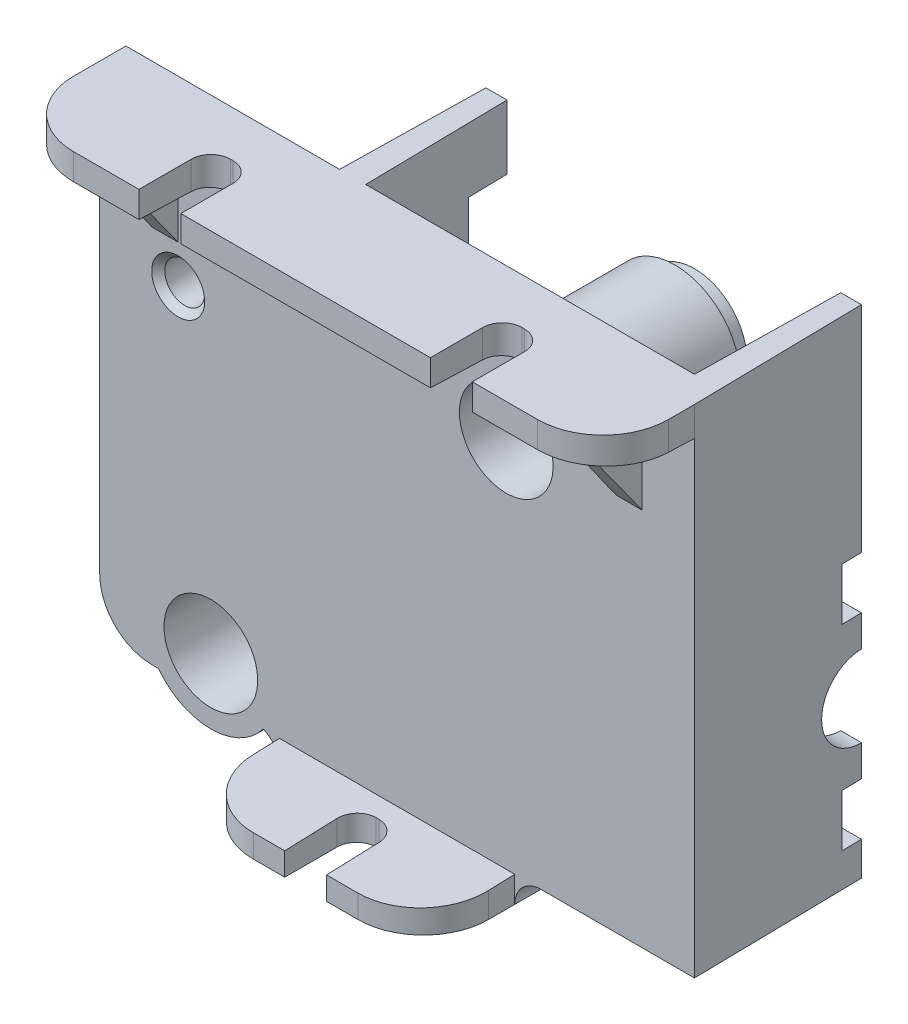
ISO-10303-21;
HEADER;
FILE_DESCRIPTION(('STEP AP214'),'2;1');
FILE_NAME('part.step','',(''),(''),'','','');
FILE_SCHEMA(('AUTOMOTIVE_DESIGN { 1 0 10303 214 1 1 1 1 }'));
ENDSEC;
DATA;
#1=APPLICATION_CONTEXT('core data for automotive mechanical design processes');
#2=APPLICATION_PROTOCOL_DEFINITION('international standard','automotive_design',2000,#1);
#3=PRODUCT_CONTEXT('',#1,'mechanical');
#4=PRODUCT('Part','Part','',(#3));
#5=PRODUCT_RELATED_PRODUCT_CATEGORY('part','',(#4));
#6=PRODUCT_DEFINITION_FORMATION('','',#4);
#7=PRODUCT_DEFINITION_CONTEXT('part definition',#1,'design');
#8=PRODUCT_DEFINITION('design','',#6,#7);
#9=PRODUCT_DEFINITION_SHAPE('','',#8);
#10=(LENGTH_UNIT() NAMED_UNIT(*) SI_UNIT(.MILLI.,.METRE.));
#11=(NAMED_UNIT(*) PLANE_ANGLE_UNIT() SI_UNIT($,.RADIAN.));
#12=(NAMED_UNIT(*) SI_UNIT($,.STERADIAN.) SOLID_ANGLE_UNIT());
#13=UNCERTAINTY_MEASURE_WITH_UNIT(LENGTH_MEASURE(1.E-05),#10,'distance_accuracy_value','');
#14=(GEOMETRIC_REPRESENTATION_CONTEXT(3) GLOBAL_UNCERTAINTY_ASSIGNED_CONTEXT((#13)) GLOBAL_UNIT_ASSIGNED_CONTEXT((#10,
#11,#12)) REPRESENTATION_CONTEXT('',''));
#15=CARTESIAN_POINT('',(0.,0.,0.));
#16=DIRECTION('',(0.,0.,1.));
#17=DIRECTION('',(1.,0.,0.));
#18=AXIS2_PLACEMENT_3D('',#15,#16,#17);
#19=CARTESIAN_POINT('',(-70.8517782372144,-13.0648359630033,-26.13));
#20=DIRECTION('',(0.,1.,0.));
#21=DIRECTION('',(0.,0.,1.));
#22=AXIS2_PLACEMENT_3D('',#19,#20,#21);
#23=PLANE('',#22);
#24=DIRECTION('',(-0.0174524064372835,0.,-0.999847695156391));
#25=VECTOR('',#24,1.);
#26=CARTESIAN_POINT('',(-25.5941681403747,-13.0648359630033,-26.9199745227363));
#27=LINE('',#26,#25);
#28=CARTESIAN_POINT('',(-25.1242782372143,-13.0648359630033,0.));
#29=VERTEX_POINT('',#28);
#30=CARTESIAN_POINT('',(-25.3523286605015,-13.0648359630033,-13.065));
#31=VERTEX_POINT('',#30);
#32=EDGE_CURVE('E2051',#29,#31,#27,.T.);
#33=ORIENTED_EDGE('',*,*,#32,.F.);
#34=DIRECTION('',(-1.,0.,0.));
#35=VECTOR('',#34,1.);
#36=CARTESIAN_POINT('',(-70.8517782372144,-13.0648359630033,0.));
#37=LINE('',#36,#35);
#38=CARTESIAN_POINT('',(-36.9330282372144,-13.0648359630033,0.));
#39=VERTEX_POINT('',#38);
#40=EDGE_CURVE('E1708',#29,#39,#37,.T.);
#41=ORIENTED_EDGE('',*,*,#40,.T.);
#42=DIRECTION('',(0.,0.,1.));
#43=VECTOR('',#42,1.);
#44=CARTESIAN_POINT('',(-36.9330282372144,-13.0648359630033,-2.00999999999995));
#45=LINE('',#44,#43);
#46=CARTESIAN_POINT('',(-36.9330282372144,-13.0648359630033,-2.00999999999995));
#47=VERTEX_POINT('',#46);
#48=EDGE_CURVE('E449',#39,#47,#45,.F.);
#49=ORIENTED_EDGE('',*,*,#48,.T.);
#50=DIRECTION('',(-1.,0.,0.));
#51=VECTOR('',#50,1.);
#52=CARTESIAN_POINT('',(-27.1342782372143,-13.0648359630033,-2.00999999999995));
#53=LINE('',#52,#51);
#54=CARTESIAN_POINT('',(-27.1342782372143,-13.0648359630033,-2.00999999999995));
#55=VERTEX_POINT('',#54);
#56=EDGE_CURVE('E368',#55,#47,#53,.T.);
#57=ORIENTED_EDGE('',*,*,#56,.F.);
#58=DIRECTION('',(0.0174524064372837,0.,-0.999847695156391));
#59=VECTOR('',#58,1.);
#60=CARTESIAN_POINT('',(-27.1342782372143,-13.0648359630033,-2.00999999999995));
#61=LINE('',#60,#59);
#62=CARTESIAN_POINT('',(-26.9413124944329,-13.0648359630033,-13.065));
#63=VERTEX_POINT('',#62);
#64=EDGE_CURVE('E788',#63,#55,#61,.F.);
#65=ORIENTED_EDGE('',*,*,#64,.F.);
#66=DIRECTION('',(-1.,0.,0.));
#67=VECTOR('',#66,1.);
#68=CARTESIAN_POINT('',(-70.8517782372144,-13.0648359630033,-13.065));
#69=LINE('',#68,#67);
#70=EDGE_CURVE('E747',#31,#63,#69,.T.);
#71=ORIENTED_EDGE('',*,*,#70,.F.);
#72=EDGE_LOOP('',(#33,#41,#49,#57,#65,#71));
#73=FACE_BOUND('',#72,.T.);
#74=ADVANCED_FACE('F16',(#73),#23,.F.);
#75=CARTESIAN_POINT('',(-25.1242782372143,-13.0648359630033,-26.13));
#76=DIRECTION('',(-1.,0.,0.));
#77=DIRECTION('',(0.,0.,-1.));
#78=AXIS2_PLACEMENT_3D('',#75,#76,#77);
#79=PLANE('',#78);
#80=DIRECTION('',(0.,-1.,0.));
#81=VECTOR('',#80,1.);
#82=CARTESIAN_POINT('',(-25.1242782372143,-13.0648359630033,-1.60392532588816E-13));
#83=LINE('',#82,#81);
#84=CARTESIAN_POINT('',(-25.1242782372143,25.1251640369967,4.18415302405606E-13));
#85=VERTEX_POINT('',#84);
#86=CARTESIAN_POINT('',(-25.1242782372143,22.8694964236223,-1.60392532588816E-13));
#87=VERTEX_POINT('',#86);
#88=EDGE_CURVE('E690',#85,#87,#83,.T.);
#89=ORIENTED_EDGE('',*,*,#88,.F.);
#90=DIRECTION('',(0.,0.,1.));
#91=VECTOR('',#90,1.);
#92=CARTESIAN_POINT('',(-25.1242782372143,25.1251640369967,-26.13));
#93=LINE('',#92,#91);
#94=CARTESIAN_POINT('',(-25.1242782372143,25.1251640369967,2.01000000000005));
#95=VERTEX_POINT('',#94);
#96=EDGE_CURVE('E1270',#85,#95,#93,.T.);
#97=ORIENTED_EDGE('',*,*,#96,.T.);
#98=DIRECTION('',(0.,1.,0.));
#99=VECTOR('',#98,1.);
#100=CARTESIAN_POINT('',(-25.1242782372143,23.1151640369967,2.01000000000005));
#101=LINE('',#100,#99);
#102=CARTESIAN_POINT('',(-25.1242782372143,22.9396871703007,2.01000000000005));
#103=VERTEX_POINT('',#102);
#104=EDGE_CURVE('E532',#95,#103,#101,.F.);
#105=ORIENTED_EDGE('',*,*,#104,.T.);
#106=DIRECTION('',(0.,-0.0348994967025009,-0.999390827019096));
#107=VECTOR('',#106,1.);
#108=CARTESIAN_POINT('',(-25.1242782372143,23.1151640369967,7.035));
#109=LINE('',#108,#107);
#110=EDGE_CURVE('E550',#103,#87,#109,.T.);
#111=ORIENTED_EDGE('',*,*,#110,.T.);
#112=EDGE_LOOP('',(#89,#97,#105,#111));
#113=FACE_BOUND('',#112,.T.);
#114=ADVANCED_FACE('F1726',(#113),#79,.F.);
#115=CARTESIAN_POINT('',(-70.8517782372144,25.1251640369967,-26.13));
#116=DIRECTION('',(0.,-1.,0.));
#117=DIRECTION('',(0.,0.,-1.));
#118=AXIS2_PLACEMENT_3D('',#115,#116,#117);
#119=PLANE('',#118);
#120=DIRECTION('',(0.0174524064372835,0.,0.999847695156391));
#121=VECTOR('',#120,1.);
#122=CARTESIAN_POINT('',(-25.5941681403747,25.1251640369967,-26.9199745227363));
#123=LINE('',#122,#121);
#124=CARTESIAN_POINT('',(-25.3523286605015,25.1251640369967,-13.065));
#125=VERTEX_POINT('',#124);
#126=EDGE_CURVE('E3389',#125,#85,#123,.T.);
#127=ORIENTED_EDGE('',*,*,#126,.F.);
#128=DIRECTION('',(1.,0.,0.));
#129=VECTOR('',#128,1.);
#130=CARTESIAN_POINT('',(-70.8517782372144,25.1251640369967,-13.065));
#131=LINE('',#130,#129);
#132=CARTESIAN_POINT('',(-26.9413124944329,25.1251640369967,-13.065));
#133=VERTEX_POINT('',#132);
#134=EDGE_CURVE('E782',#133,#125,#131,.T.);
#135=ORIENTED_EDGE('',*,*,#134,.F.);
#136=DIRECTION('',(0.0174524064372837,0.,-0.999847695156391));
#137=VECTOR('',#136,1.);
#138=CARTESIAN_POINT('',(-26.7267060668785,25.1251640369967,-25.3597940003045));
#139=LINE('',#138,#137);
#140=CARTESIAN_POINT('',(-27.1342782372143,25.1251640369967,-2.00999999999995));
#141=VERTEX_POINT('',#140);
#142=EDGE_CURVE('E378',#133,#141,#139,.F.);
#143=ORIENTED_EDGE('',*,*,#142,.T.);
#144=DIRECTION('',(-1.,0.,0.));
#145=VECTOR('',#144,1.);
#146=CARTESIAN_POINT('',(-70.8517782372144,25.1251640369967,-2.00999999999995));
#147=LINE('',#146,#145);
#148=CARTESIAN_POINT('',(-52.4100282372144,25.1251640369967,-2.00999999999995));
#149=VERTEX_POINT('',#148);
#150=EDGE_CURVE('E379',#141,#149,#147,.T.);
#151=ORIENTED_EDGE('',*,*,#150,.T.);
#152=DIRECTION('',(0.0174524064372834,0.,0.999847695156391));
#153=VECTOR('',#152,1.);
#154=CARTESIAN_POINT('',(-52.8365332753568,25.1251640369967,-26.4444572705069));
#155=LINE('',#154,#153);
#156=CARTESIAN_POINT('',(-52.6029939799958,25.1251640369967,-13.065));
#157=VERTEX_POINT('',#156);
#158=EDGE_CURVE('E374',#149,#157,#155,.F.);
#159=ORIENTED_EDGE('',*,*,#158,.T.);
#160=CARTESIAN_POINT('',(-54.2270624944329,25.1251640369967,-13.065));
#161=VERTEX_POINT('',#160);
#162=EDGE_CURVE('E381',#161,#157,#131,.T.);
#163=ORIENTED_EDGE('',*,*,#162,.F.);
#164=DIRECTION('',(0.0174524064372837,0.,-0.999847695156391));
#165=VECTOR('',#164,1.);
#166=CARTESIAN_POINT('',(-54.0041451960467,25.1251640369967,-25.8359234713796));
#167=LINE('',#166,#165);
#168=CARTESIAN_POINT('',(-54.4200282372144,25.1251640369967,-2.00999999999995));
#169=VERTEX_POINT('',#168);
#170=EDGE_CURVE('E785',#161,#169,#167,.F.);
#171=ORIENTED_EDGE('',*,*,#170,.T.);
#172=DIRECTION('',(-1.,0.,0.));
#173=VECTOR('',#172,1.);
#174=CARTESIAN_POINT('',(-70.8517782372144,25.1251640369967,-2.00999999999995));
#175=LINE('',#174,#173);
#176=CARTESIAN_POINT('',(-70.8517782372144,25.1251640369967,-2.00999999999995));
#177=VERTEX_POINT('',#176);
#178=EDGE_CURVE('E801',#169,#177,#175,.T.);
#179=ORIENTED_EDGE('',*,*,#178,.T.);
#180=DIRECTION('',(0.,0.,1.));
#181=VECTOR('',#180,1.);
#182=CARTESIAN_POINT('',(-70.8517782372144,25.1251640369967,-26.13));
#183=LINE('',#182,#181);
#184=CARTESIAN_POINT('',(-70.8517782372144,25.1251640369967,2.01000000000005));
#185=VERTEX_POINT('',#184);
#186=EDGE_CURVE('E1260',#177,#185,#183,.T.);
#187=ORIENTED_EDGE('',*,*,#186,.T.);
#188=CARTESIAN_POINT('',(-65.8267782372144,25.1251640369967,2.01000000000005));
#189=DIRECTION('',(0.,-1.,0.));
#190=DIRECTION('',(0.,0.,-1.));
#191=AXIS2_PLACEMENT_3D('',#188,#189,#190);
#192=CIRCLE('',#191,5.025);
#193=CARTESIAN_POINT('',(-65.8267782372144,25.1251640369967,7.035));
#194=VERTEX_POINT('',#193);
#195=EDGE_CURVE('E497',#185,#194,#192,.F.);
#196=ORIENTED_EDGE('',*,*,#195,.T.);
#197=DIRECTION('',(1.,0.,0.));
#198=VECTOR('',#197,1.);
#199=CARTESIAN_POINT('',(-70.8517782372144,25.1251640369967,7.035));
#200=LINE('',#199,#198);
#201=CARTESIAN_POINT('',(-60.8017782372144,25.1251640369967,7.035));
#202=VERTEX_POINT('',#201);
#203=EDGE_CURVE('E556',#194,#202,#200,.T.);
#204=ORIENTED_EDGE('',*,*,#203,.T.);
#205=DIRECTION('',(0.,0.,-1.));
#206=VECTOR('',#205,1.);
#207=CARTESIAN_POINT('',(-60.8017782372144,25.1251640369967,8.61871782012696));
#208=LINE('',#207,#206);
#209=CARTESIAN_POINT('',(-60.8017782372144,25.1251640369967,3.01500000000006));
#210=VERTEX_POINT('',#209);
#211=EDGE_CURVE('E580',#202,#210,#208,.T.);
#212=ORIENTED_EDGE('',*,*,#211,.T.);
#213=CARTESIAN_POINT('',(-59.2942782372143,25.1251640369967,3.01500000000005));
#214=DIRECTION('',(0.,-1.,0.));
#215=DIRECTION('',(0.,0.,1.));
#216=AXIS2_PLACEMENT_3D('',#213,#214,#215);
#217=CIRCLE('',#216,1.5075);
#218=CARTESIAN_POINT('',(-59.2942782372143,25.1251640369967,1.50750000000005));
#219=VERTEX_POINT('',#218);
#220=EDGE_CURVE('E1311',#210,#219,#217,.T.);
#221=ORIENTED_EDGE('',*,*,#220,.T.);
#222=DIRECTION('',(1.,0.,0.));
#223=VECTOR('',#222,1.);
#224=CARTESIAN_POINT('',(-59.2942782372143,25.1251640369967,1.50750000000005));
#225=LINE('',#224,#223);
#226=CARTESIAN_POINT('',(-59.0932782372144,25.1251640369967,1.50750000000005));
#227=VERTEX_POINT('',#226);
#228=EDGE_CURVE('E1323',#219,#227,#225,.T.);
#229=ORIENTED_EDGE('',*,*,#228,.T.);
#230=CARTESIAN_POINT('',(-59.0932782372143,25.1251640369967,3.01500000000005));
#231=DIRECTION('',(0.,-1.,0.));
#232=DIRECTION('',(0.,0.,1.));
#233=AXIS2_PLACEMENT_3D('',#230,#231,#232);
#234=CIRCLE('',#233,1.5075);
#235=CARTESIAN_POINT('',(-57.5857782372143,25.1251640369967,3.01500000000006));
#236=VERTEX_POINT('',#235);
#237=EDGE_CURVE('E1335',#227,#236,#234,.T.);
#238=ORIENTED_EDGE('',*,*,#237,.T.);
#239=DIRECTION('',(0.,0.,1.));
#240=VECTOR('',#239,1.);
#241=CARTESIAN_POINT('',(-57.5857782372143,25.1251640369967,8.61871782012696));
#242=LINE('',#241,#240);
#243=CARTESIAN_POINT('',(-57.5857782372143,25.1251640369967,7.035));
#244=VERTEX_POINT('',#243);
#245=EDGE_CURVE('E503',#236,#244,#242,.T.);
#246=ORIENTED_EDGE('',*,*,#245,.T.);
#247=CARTESIAN_POINT('',(-38.3902782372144,25.1251640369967,7.035));
#248=VERTEX_POINT('',#247);
#249=EDGE_CURVE('E1296',#244,#248,#200,.T.);
#250=ORIENTED_EDGE('',*,*,#249,.T.);
#251=DIRECTION('',(0.,0.,-1.));
#252=VECTOR('',#251,1.);
#253=CARTESIAN_POINT('',(-38.3902782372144,25.1251640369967,8.61871782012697));
#254=LINE('',#253,#252);
#255=CARTESIAN_POINT('',(-38.3902782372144,25.1251640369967,3.01500000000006));
#256=VERTEX_POINT('',#255);
#257=EDGE_CURVE('E523',#248,#256,#254,.T.);
#258=ORIENTED_EDGE('',*,*,#257,.T.);
#259=CARTESIAN_POINT('',(-36.8827782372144,25.1251640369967,3.01500000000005));
#260=DIRECTION('',(0.,-1.,0.));
#261=DIRECTION('',(0.,0.,-1.));
#262=AXIS2_PLACEMENT_3D('',#259,#260,#261);
#263=CIRCLE('',#262,1.5075);
#264=CARTESIAN_POINT('',(-36.8827782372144,25.1251640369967,1.50750000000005));
#265=VERTEX_POINT('',#264);
#266=EDGE_CURVE('E587',#256,#265,#263,.T.);
#267=ORIENTED_EDGE('',*,*,#266,.T.);
#268=DIRECTION('',(1.,0.,0.));
#269=VECTOR('',#268,1.);
#270=CARTESIAN_POINT('',(-36.6817782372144,25.1251640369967,1.50750000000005));
#271=LINE('',#270,#269);
#272=CARTESIAN_POINT('',(-36.6817782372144,25.1251640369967,1.50750000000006));
#273=VERTEX_POINT('',#272);
#274=EDGE_CURVE('E1392',#265,#273,#271,.T.);
#275=ORIENTED_EDGE('',*,*,#274,.T.);
#276=CARTESIAN_POINT('',(-36.6817782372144,25.1251640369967,3.01500000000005));
#277=DIRECTION('',(0.,-1.,0.));
#278=DIRECTION('',(0.,0.,-1.));
#279=AXIS2_PLACEMENT_3D('',#276,#277,#278);
#280=CIRCLE('',#279,1.5075);
#281=CARTESIAN_POINT('',(-35.1742782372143,25.1251640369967,3.01500000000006));
#282=VERTEX_POINT('',#281);
#283=EDGE_CURVE('E1405',#273,#282,#280,.T.);
#284=ORIENTED_EDGE('',*,*,#283,.T.);
#285=DIRECTION('',(0.,0.,1.));
#286=VECTOR('',#285,1.);
#287=CARTESIAN_POINT('',(-35.1742782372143,25.1251640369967,8.61871782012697));
#288=LINE('',#287,#286);
#289=CARTESIAN_POINT('',(-35.1742782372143,25.1251640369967,7.035));
#290=VERTEX_POINT('',#289);
#291=EDGE_CURVE('E1379',#282,#290,#288,.T.);
#292=ORIENTED_EDGE('',*,*,#291,.T.);
#293=CARTESIAN_POINT('',(-30.1492782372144,25.1251640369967,7.035));
#294=VERTEX_POINT('',#293);
#295=EDGE_CURVE('E1298',#290,#294,#200,.T.);
#296=ORIENTED_EDGE('',*,*,#295,.T.);
#297=CARTESIAN_POINT('',(-30.1492782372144,25.1251640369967,2.01000000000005));
#298=DIRECTION('',(0.,-1.,0.));
#299=DIRECTION('',(0.,0.,-1.));
#300=AXIS2_PLACEMENT_3D('',#297,#298,#299);
#301=CIRCLE('',#300,5.025);
#302=EDGE_CURVE('E491',#294,#95,#301,.F.);
#303=ORIENTED_EDGE('',*,*,#302,.T.);
#304=ORIENTED_EDGE('',*,*,#96,.F.);
#305=EDGE_LOOP('',(#127,#135,#143,#151,#159,#163,#171,#179,#187,#196,#204,#212,#221,#229,#238,
#246,#250,#258,#267,#275,#284,#292,#296,#303,#304));
#306=FACE_BOUND('',#305,.T.);
#307=ADVANCED_FACE('F1735',(#306),#119,.F.);
#308=CARTESIAN_POINT('',(-28.1392782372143,-0.924435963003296,-13.065));
#309=DIRECTION('',(1.,0.,0.));
#310=DIRECTION('',(0.,-1.,0.));
#311=AXIS2_PLACEMENT_3D('',#308,#309,#310);
#312=CYLINDRICAL_SURFACE('',#311,3.1155);
#313=CARTESIAN_POINT('',(-25.3523286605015,-0.924435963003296,-13.065));
#314=DIRECTION('',(0.999847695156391,0.,-0.0174524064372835));
#315=DIRECTION('',(0.0174524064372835,0.,0.999847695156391));
#316=AXIS2_PLACEMENT_3D('',#313,#314,#315);
#317=ELLIPSE('',#316,3.11597457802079,3.1155);
#318=CARTESIAN_POINT('',(-25.3523286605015,-4.03993596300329,-13.065));
#319=VERTEX_POINT('',#318);
#320=CARTESIAN_POINT('',(-25.3523286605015,2.19106403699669,-13.065));
#321=VERTEX_POINT('',#320);
#322=EDGE_CURVE('E1448',#319,#321,#317,.F.);
#323=ORIENTED_EDGE('',*,*,#322,.F.);
#324=DIRECTION('',(1.,0.,0.));
#325=VECTOR('',#324,1.);
#326=CARTESIAN_POINT('',(-28.1392782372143,-4.03993596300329,-13.065));
#327=LINE('',#326,#325);
#328=CARTESIAN_POINT('',(-26.9413124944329,-4.03993596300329,-13.065));
#329=VERTEX_POINT('',#328);
#330=EDGE_CURVE('E725',#329,#319,#327,.T.);
#331=ORIENTED_EDGE('',*,*,#330,.F.);
#332=CARTESIAN_POINT('',(-26.9413124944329,-0.924435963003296,-13.065));
#333=DIRECTION('',(-0.999847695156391,0.,-0.0174524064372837));
#334=DIRECTION('',(0.0174524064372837,0.,-0.999847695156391));
#335=AXIS2_PLACEMENT_3D('',#332,#333,#334);
#336=ELLIPSE('',#335,3.11597457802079,3.1155);
#337=CARTESIAN_POINT('',(-26.9413124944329,2.19106403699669,-13.065));
#338=VERTEX_POINT('',#337);
#339=EDGE_CURVE('E615',#338,#329,#336,.F.);
#340=ORIENTED_EDGE('',*,*,#339,.F.);
#341=DIRECTION('',(1.,0.,0.));
#342=VECTOR('',#341,1.);
#343=CARTESIAN_POINT('',(-28.1392782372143,2.19106403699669,-13.065));
#344=LINE('',#343,#342);
#345=EDGE_CURVE('E731',#321,#338,#344,.F.);
#346=ORIENTED_EDGE('',*,*,#345,.F.);
#347=EDGE_LOOP('',(#323,#331,#340,#346));
#348=FACE_BOUND('',#347,.T.);
#349=ADVANCED_FACE('F2023',(#348),#312,.F.);
#350=CARTESIAN_POINT('',(-28.1392782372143,-6.4519359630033,-11.5575));
#351=DIRECTION('',(0.,1.,0.));
#352=DIRECTION('',(0.,0.,1.));
#353=AXIS2_PLACEMENT_3D('',#350,#351,#352);
#354=PLANE('',#353);
#355=DIRECTION('',(-0.0174524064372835,0.,-0.999847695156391));
#356=VECTOR('',#355,1.);
#357=CARTESIAN_POINT('',(-25.3268720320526,-6.4519359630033,-11.6065907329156));
#358=LINE('',#357,#356);
#359=CARTESIAN_POINT('',(-25.3260151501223,-6.4519359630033,-11.5575));
#360=VERTEX_POINT('',#359);
#361=CARTESIAN_POINT('',(-25.3523286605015,-6.4519359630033,-13.065));
#362=VERTEX_POINT('',#361);
#363=EDGE_CURVE('E34',#360,#362,#358,.T.);
#364=ORIENTED_EDGE('',*,*,#363,.F.);
#365=DIRECTION('',(1.,0.,0.));
#366=VECTOR('',#365,1.);
#367=CARTESIAN_POINT('',(-28.1392782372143,-6.4519359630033,-11.5575));
#368=LINE('',#367,#366);
#369=CARTESIAN_POINT('',(-26.9676260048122,-6.4519359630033,-11.5575));
#370=VERTEX_POINT('',#369);
#371=EDGE_CURVE('E594',#370,#360,#368,.T.);
#372=ORIENTED_EDGE('',*,*,#371,.F.);
#373=DIRECTION('',(0.0174524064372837,0.,-0.999847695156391));
#374=VECTOR('',#373,1.);
#375=CARTESIAN_POINT('',(-27.1342782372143,-6.4519359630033,-2.00999999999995));
#376=LINE('',#375,#374);
#377=CARTESIAN_POINT('',(-26.9413124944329,-6.4519359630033,-13.065));
#378=VERTEX_POINT('',#377);
#379=EDGE_CURVE('E752',#378,#370,#376,.F.);
#380=ORIENTED_EDGE('',*,*,#379,.F.);
#381=DIRECTION('',(-1.,0.,0.));
#382=VECTOR('',#381,1.);
#383=CARTESIAN_POINT('',(-28.1392782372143,-6.4519359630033,-13.065));
#384=LINE('',#383,#382);
#385=EDGE_CURVE('E763',#362,#378,#384,.T.);
#386=ORIENTED_EDGE('',*,*,#385,.F.);
#387=EDGE_LOOP('',(#364,#372,#380,#386));
#388=FACE_BOUND('',#387,.T.);
#389=ADVANCED_FACE('F2032',(#388),#354,.F.);
#390=CARTESIAN_POINT('',(-28.1392782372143,-10.4719359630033,-11.5575));
#391=DIRECTION('',(0.,-1.,0.));
#392=DIRECTION('',(0.,0.,-1.));
#393=AXIS2_PLACEMENT_3D('',#390,#391,#392);
#394=PLANE('',#393);
#395=DIRECTION('',(0.0174524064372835,0.,0.999847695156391));
#396=VECTOR('',#395,1.);
#397=CARTESIAN_POINT('',(-25.3268720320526,-10.4719359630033,-11.6065907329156));
#398=LINE('',#397,#396);
#399=CARTESIAN_POINT('',(-25.3523286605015,-10.4719359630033,-13.065));
#400=VERTEX_POINT('',#399);
#401=CARTESIAN_POINT('',(-25.3260151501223,-10.4719359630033,-11.5575));
#402=VERTEX_POINT('',#401);
#403=EDGE_CURVE('E2043',#400,#402,#398,.T.);
#404=ORIENTED_EDGE('',*,*,#403,.F.);
#405=DIRECTION('',(1.,0.,0.));
#406=VECTOR('',#405,1.);
#407=CARTESIAN_POINT('',(-28.1392782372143,-10.4719359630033,-13.065));
#408=LINE('',#407,#406);
#409=CARTESIAN_POINT('',(-26.9413124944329,-10.4719359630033,-13.065));
#410=VERTEX_POINT('',#409);
#411=EDGE_CURVE('E734',#410,#400,#408,.T.);
#412=ORIENTED_EDGE('',*,*,#411,.F.);
#413=DIRECTION('',(-0.0174524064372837,0.,0.999847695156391));
#414=VECTOR('',#413,1.);
#415=CARTESIAN_POINT('',(-27.1342782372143,-10.4719359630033,-2.00999999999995));
#416=LINE('',#415,#414);
#417=CARTESIAN_POINT('',(-26.9676260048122,-10.4719359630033,-11.5575));
#418=VERTEX_POINT('',#417);
#419=EDGE_CURVE('E748',#418,#410,#416,.F.);
#420=ORIENTED_EDGE('',*,*,#419,.F.);
#421=DIRECTION('',(1.,0.,0.));
#422=VECTOR('',#421,1.);
#423=CARTESIAN_POINT('',(-28.1392782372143,-10.4719359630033,-11.5575));
#424=LINE('',#423,#422);
#425=EDGE_CURVE('E1481',#418,#402,#424,.T.);
#426=ORIENTED_EDGE('',*,*,#425,.T.);
#427=EDGE_LOOP('',(#404,#412,#420,#426));
#428=FACE_BOUND('',#427,.T.);
#429=ADVANCED_FACE('F2042',(#428),#394,.F.);
#430=CARTESIAN_POINT('',(-28.1392782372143,4.60306403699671,-11.5575));
#431=DIRECTION('',(0.,-1.,0.));
#432=DIRECTION('',(0.,0.,-1.));
#433=AXIS2_PLACEMENT_3D('',#430,#431,#432);
#434=PLANE('',#433);
#435=DIRECTION('',(0.0174524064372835,0.,0.999847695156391));
#436=VECTOR('',#435,1.);
#437=CARTESIAN_POINT('',(-25.3268720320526,4.60306403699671,-11.6065907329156));
#438=LINE('',#437,#436);
#439=CARTESIAN_POINT('',(-25.3523286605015,4.60306403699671,-13.065));
#440=VERTEX_POINT('',#439);
#441=CARTESIAN_POINT('',(-25.3260151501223,4.60306403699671,-11.5575));
#442=VERTEX_POINT('',#441);
#443=EDGE_CURVE('E3454',#440,#442,#438,.T.);
#444=ORIENTED_EDGE('',*,*,#443,.F.);
#445=DIRECTION('',(1.,0.,0.));
#446=VECTOR('',#445,1.);
#447=CARTESIAN_POINT('',(-28.1392782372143,4.60306403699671,-13.065));
#448=LINE('',#447,#446);
#449=CARTESIAN_POINT('',(-26.9413124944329,4.60306403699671,-13.065));
#450=VERTEX_POINT('',#449);
#451=EDGE_CURVE('E769',#450,#440,#448,.T.);
#452=ORIENTED_EDGE('',*,*,#451,.F.);
#453=DIRECTION('',(-0.0174524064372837,0.,0.999847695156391));
#454=VECTOR('',#453,1.);
#455=CARTESIAN_POINT('',(-27.1342782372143,4.60306403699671,-2.00999999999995));
#456=LINE('',#455,#454);
#457=CARTESIAN_POINT('',(-26.9676260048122,4.60306403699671,-11.5575));
#458=VERTEX_POINT('',#457);
#459=EDGE_CURVE('E492',#458,#450,#456,.F.);
#460=ORIENTED_EDGE('',*,*,#459,.F.);
#461=DIRECTION('',(1.,0.,0.));
#462=VECTOR('',#461,1.);
#463=CARTESIAN_POINT('',(-28.1392782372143,4.60306403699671,-11.5575));
#464=LINE('',#463,#462);
#465=EDGE_CURVE('E1673',#458,#442,#464,.T.);
#466=ORIENTED_EDGE('',*,*,#465,.T.);
#467=EDGE_LOOP('',(#444,#452,#460,#466));
#468=FACE_BOUND('',#467,.T.);
#469=ADVANCED_FACE('F2272',(#468),#434,.F.);
#470=CARTESIAN_POINT('',(-28.1392782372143,8.6230640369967,-11.5575));
#471=DIRECTION('',(0.,1.,0.));
#472=DIRECTION('',(0.,0.,1.));
#473=AXIS2_PLACEMENT_3D('',#470,#471,#472);
#474=PLANE('',#473);
#475=DIRECTION('',(-0.0174524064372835,0.,-0.999847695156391));
#476=VECTOR('',#475,1.);
#477=CARTESIAN_POINT('',(-25.3268720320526,8.6230640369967,-11.6065907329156));
#478=LINE('',#477,#476);
#479=CARTESIAN_POINT('',(-25.3260151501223,8.6230640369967,-11.5575));
#480=VERTEX_POINT('',#479);
#481=CARTESIAN_POINT('',(-25.3523286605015,8.6230640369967,-13.065));
#482=VERTEX_POINT('',#481);
#483=EDGE_CURVE('E1669',#480,#482,#478,.T.);
#484=ORIENTED_EDGE('',*,*,#483,.F.);
#485=DIRECTION('',(1.,0.,0.));
#486=VECTOR('',#485,1.);
#487=CARTESIAN_POINT('',(-28.1392782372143,8.6230640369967,-11.5575));
#488=LINE('',#487,#486);
#489=CARTESIAN_POINT('',(-26.9676260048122,8.6230640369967,-11.5575));
#490=VERTEX_POINT('',#489);
#491=EDGE_CURVE('E1666',#490,#480,#488,.T.);
#492=ORIENTED_EDGE('',*,*,#491,.F.);
#493=DIRECTION('',(0.0174524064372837,0.,-0.999847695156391));
#494=VECTOR('',#493,1.);
#495=CARTESIAN_POINT('',(-27.1342782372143,8.6230640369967,-2.00999999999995));
#496=LINE('',#495,#494);
#497=CARTESIAN_POINT('',(-26.9413124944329,8.6230640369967,-13.065));
#498=VERTEX_POINT('',#497);
#499=EDGE_CURVE('E758',#498,#490,#496,.F.);
#500=ORIENTED_EDGE('',*,*,#499,.F.);
#501=DIRECTION('',(-1.,0.,0.));
#502=VECTOR('',#501,1.);
#503=CARTESIAN_POINT('',(-28.1392782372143,8.6230640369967,-13.065));
#504=LINE('',#503,#502);
#505=EDGE_CURVE('E426',#482,#498,#504,.T.);
#506=ORIENTED_EDGE('',*,*,#505,.F.);
#507=EDGE_LOOP('',(#484,#492,#500,#506));
#508=FACE_BOUND('',#507,.T.);
#509=ADVANCED_FACE('F1664',(#508),#474,.F.);
#510=CARTESIAN_POINT('',(-28.1392782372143,-6.4519359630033,-11.5575));
#511=DIRECTION('',(0.,0.,1.));
#512=DIRECTION('',(-1.,0.,0.));
#513=AXIS2_PLACEMENT_3D('',#510,#511,#512);
#514=PLANE('',#513);
#515=DIRECTION('',(0.,1.,0.));
#516=VECTOR('',#515,1.);
#517=CARTESIAN_POINT('',(-25.3260151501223,-6.4519359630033,-11.5575));
#518=LINE('',#517,#516);
#519=EDGE_CURVE('E2037',#402,#360,#518,.T.);
#520=ORIENTED_EDGE('',*,*,#519,.F.);
#521=ORIENTED_EDGE('',*,*,#425,.F.);
#522=DIRECTION('',(0.,1.,0.));
#523=VECTOR('',#522,1.);
#524=CARTESIAN_POINT('',(-26.9676260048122,27.1351640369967,-11.5575));
#525=LINE('',#524,#523);
#526=EDGE_CURVE('E754',#370,#418,#525,.F.);
#527=ORIENTED_EDGE('',*,*,#526,.F.);
#528=ORIENTED_EDGE('',*,*,#371,.T.);
#529=EDGE_LOOP('',(#520,#521,#527,#528));
#530=FACE_BOUND('',#529,.T.);
#531=ADVANCED_FACE('F2035',(#530),#514,.F.);
#532=CARTESIAN_POINT('',(-28.1392782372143,4.60306403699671,-11.5575));
#533=DIRECTION('',(0.,0.,1.));
#534=DIRECTION('',(-1.,0.,0.));
#535=AXIS2_PLACEMENT_3D('',#532,#533,#534);
#536=PLANE('',#535);
#537=DIRECTION('',(0.,1.,0.));
#538=VECTOR('',#537,1.);
#539=CARTESIAN_POINT('',(-25.3260151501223,4.60306403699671,-11.5575));
#540=LINE('',#539,#538);
#541=EDGE_CURVE('E3425',#442,#480,#540,.T.);
#542=ORIENTED_EDGE('',*,*,#541,.F.);
#543=ORIENTED_EDGE('',*,*,#465,.F.);
#544=DIRECTION('',(0.,1.,0.));
#545=VECTOR('',#544,1.);
#546=CARTESIAN_POINT('',(-26.9676260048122,27.1351640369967,-11.5575));
#547=LINE('',#546,#545);
#548=EDGE_CURVE('E773',#490,#458,#547,.F.);
#549=ORIENTED_EDGE('',*,*,#548,.F.);
#550=ORIENTED_EDGE('',*,*,#491,.T.);
#551=EDGE_LOOP('',(#542,#543,#549,#550));
#552=FACE_BOUND('',#551,.T.);
#553=ADVANCED_FACE('F2267',(#552),#536,.F.);
#554=CARTESIAN_POINT('',(-73.5377907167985,26.4835161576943,-13.065));
#555=DIRECTION('',(0.,0.,-1.));
#556=DIRECTION('',(1.,0.,0.));
#557=AXIS2_PLACEMENT_3D('',#554,#555,#556);
#558=PLANE('',#557);
#559=ORIENTED_EDGE('',*,*,#134,.T.);
#560=DIRECTION('',(0.,-1.,0.));
#561=VECTOR('',#560,1.);
#562=CARTESIAN_POINT('',(-25.3523286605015,26.4835161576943,-13.065));
#563=LINE('',#562,#561);
#564=EDGE_CURVE('E1653',#125,#482,#563,.T.);
#565=ORIENTED_EDGE('',*,*,#564,.T.);
#566=ORIENTED_EDGE('',*,*,#505,.T.);
#567=DIRECTION('',(0.,-1.,0.));
#568=VECTOR('',#567,1.);
#569=CARTESIAN_POINT('',(-26.9413124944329,27.1351640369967,-13.065));
#570=LINE('',#569,#568);
#571=EDGE_CURVE('E779',#498,#133,#570,.F.);
#572=ORIENTED_EDGE('',*,*,#571,.T.);
#573=EDGE_LOOP('',(#559,#565,#566,#572));
#574=FACE_BOUND('',#573,.T.);
#575=ADVANCED_FACE('F1649',(#574),#558,.T.);
#576=ORIENTED_EDGE('',*,*,#451,.T.);
#577=DIRECTION('',(0.,-1.,0.));
#578=VECTOR('',#577,1.);
#579=CARTESIAN_POINT('',(-25.3523286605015,26.4835161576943,-13.065));
#580=LINE('',#579,#578);
#581=EDGE_CURVE('E1457',#440,#321,#580,.T.);
#582=ORIENTED_EDGE('',*,*,#581,.T.);
#583=ORIENTED_EDGE('',*,*,#345,.T.);
#584=DIRECTION('',(0.,-1.,0.));
#585=VECTOR('',#584,1.);
#586=CARTESIAN_POINT('',(-26.9413124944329,27.1351640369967,-13.065));
#587=LINE('',#586,#585);
#588=EDGE_CURVE('E735',#338,#450,#587,.F.);
#589=ORIENTED_EDGE('',*,*,#588,.T.);
#590=EDGE_LOOP('',(#576,#582,#583,#589));
#591=FACE_BOUND('',#590,.T.);
#592=ADVANCED_FACE('F3492',(#591),#558,.T.);
#593=ORIENTED_EDGE('',*,*,#411,.T.);
#594=DIRECTION('',(0.,-1.,0.));
#595=VECTOR('',#594,1.);
#596=CARTESIAN_POINT('',(-25.3523286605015,26.4835161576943,-13.065));
#597=LINE('',#596,#595);
#598=EDGE_CURVE('E2047',#400,#31,#597,.T.);
#599=ORIENTED_EDGE('',*,*,#598,.T.);
#600=ORIENTED_EDGE('',*,*,#70,.T.);
#601=DIRECTION('',(0.,-1.,0.));
#602=VECTOR('',#601,1.);
#603=CARTESIAN_POINT('',(-26.9413124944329,27.1351640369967,-13.065));
#604=LINE('',#603,#602);
#605=EDGE_CURVE('E744',#63,#410,#604,.F.);
#606=ORIENTED_EDGE('',*,*,#605,.T.);
#607=EDGE_LOOP('',(#593,#599,#600,#606));
#608=FACE_BOUND('',#607,.T.);
#609=ADVANCED_FACE('F2046',(#608),#558,.T.);
#610=ORIENTED_EDGE('',*,*,#330,.T.);
#611=DIRECTION('',(0.,-1.,0.));
#612=VECTOR('',#611,1.);
#613=CARTESIAN_POINT('',(-25.3523286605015,26.4835161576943,-13.065));
#614=LINE('',#613,#612);
#615=EDGE_CURVE('E11',#319,#362,#614,.T.);
#616=ORIENTED_EDGE('',*,*,#615,.T.);
#617=ORIENTED_EDGE('',*,*,#385,.T.);
#618=DIRECTION('',(0.,-1.,0.));
#619=VECTOR('',#618,1.);
#620=CARTESIAN_POINT('',(-26.9413124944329,27.1351640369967,-13.065));
#621=LINE('',#620,#619);
#622=EDGE_CURVE('E730',#378,#329,#621,.F.);
#623=ORIENTED_EDGE('',*,*,#622,.T.);
#624=EDGE_LOOP('',(#610,#616,#617,#623));
#625=FACE_BOUND('',#624,.T.);
#626=ADVANCED_FACE('F2025',(#625),#558,.T.);
#627=DIRECTION('',(1.,0.,0.));
#628=VECTOR('',#627,1.);
#629=CARTESIAN_POINT('',(-38.9430282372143,-13.0648359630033,-2.00999999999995));
#630=LINE('',#629,#628);
#631=CARTESIAN_POINT('',(-54.4200282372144,-13.0648359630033,-2.00999999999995));
#632=VERTEX_POINT('',#631);
#633=CARTESIAN_POINT('',(-52.4100282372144,-13.0648359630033,-2.00999999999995));
#634=VERTEX_POINT('',#633);
#635=EDGE_CURVE('E714',#632,#634,#630,.T.);
#636=ORIENTED_EDGE('',*,*,#635,.F.);
#637=DIRECTION('',(0.0174524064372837,0.,-0.999847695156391));
#638=VECTOR('',#637,1.);
#639=CARTESIAN_POINT('',(-54.4200282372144,-13.0648359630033,-2.00999999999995));
#640=LINE('',#639,#638);
#641=CARTESIAN_POINT('',(-54.2270624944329,-13.0648359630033,-13.065));
#642=VERTEX_POINT('',#641);
#643=EDGE_CURVE('E803',#642,#632,#640,.F.);
#644=ORIENTED_EDGE('',*,*,#643,.F.);
#645=CARTESIAN_POINT('',(-52.6029939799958,-13.0648359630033,-13.065));
#646=VERTEX_POINT('',#645);
#647=EDGE_CURVE('E361',#646,#642,#69,.T.);
#648=ORIENTED_EDGE('',*,*,#647,.F.);
#649=DIRECTION('',(0.0174524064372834,0.,0.999847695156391));
#650=VECTOR('',#649,1.);
#651=CARTESIAN_POINT('',(-52.4100282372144,-13.0648359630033,-2.00999999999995));
#652=LINE('',#651,#650);
#653=EDGE_CURVE('E363',#634,#646,#652,.F.);
#654=ORIENTED_EDGE('',*,*,#653,.F.);
#655=EDGE_LOOP('',(#636,#644,#648,#654));
#656=FACE_BOUND('',#655,.T.);
#657=ADVANCED_FACE('F1891',(#656),#23,.F.);
#658=CARTESIAN_POINT('',(-25.1242782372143,25.1251640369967,0.));
#659=DIRECTION('',(0.,0.,-1.));
#660=DIRECTION('',(1.,0.,0.));
#661=AXIS2_PLACEMENT_3D('',#658,#659,#660);
#662=PLANE('',#661);
#663=CARTESIAN_POINT('',(-62.3092782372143,-10.0498359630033,0.));
#664=DIRECTION('',(0.,0.,-1.));
#665=DIRECTION('',(-1.,0.,0.));
#666=AXIS2_PLACEMENT_3D('',#663,#664,#665);
#667=CIRCLE('',#666,3.60204910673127);
#668=CARTESIAN_POINT('',(-65.9113273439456,-10.0498359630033,0.));
#669=VERTEX_POINT('',#668);
#670=EDGE_CURVE('E20',#669,#669,#667,.F.);
#671=ORIENTED_EDGE('',*,*,#670,.F.);
#672=EDGE_LOOP('',(#671));
#673=FACE_BOUND('',#672,.T.);
#674=CARTESIAN_POINT('',(-39.5967577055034,15.5776640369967,0.));
#675=DIRECTION('',(0.,0.,-1.));
#676=DIRECTION('',(-1.,0.,0.));
#677=AXIS2_PLACEMENT_3D('',#674,#675,#676);
#678=CIRCLE('',#677,3.60204910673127);
#679=CARTESIAN_POINT('',(-43.1988068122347,15.5776640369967,0.));
#680=VERTEX_POINT('',#679);
#681=EDGE_CURVE('E382',#680,#680,#678,.F.);
#682=ORIENTED_EDGE('',*,*,#681,.F.);
#683=EDGE_LOOP('',(#682));
#684=FACE_BOUND('',#683,.T.);
#685=CARTESIAN_POINT('',(-64.8217782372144,13.1455640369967,0.));
#686=DIRECTION('',(0.,0.,-1.));
#687=DIRECTION('',(1.,0.,0.));
#688=AXIS2_PLACEMENT_3D('',#685,#686,#687);
#689=CIRCLE('',#688,2.035125);
#690=CARTESIAN_POINT('',(-62.7866532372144,13.1455640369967,0.));
#691=VERTEX_POINT('',#690);
#692=EDGE_CURVE('E1623',#691,#691,#689,.T.);
#693=ORIENTED_EDGE('',*,*,#692,.T.);
#694=EDGE_LOOP('',(#693));
#695=FACE_BOUND('',#694,.T.);
#696=DIRECTION('',(0.,1.,0.));
#697=VECTOR('',#696,1.);
#698=CARTESIAN_POINT('',(-31.1542782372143,25.1251640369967,0.));
#699=LINE('',#698,#697);
#700=CARTESIAN_POINT('',(-31.1542782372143,22.8694964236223,0.));
#701=VERTEX_POINT('',#700);
#702=CARTESIAN_POINT('',(-31.1542782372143,16.0801640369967,0.));
#703=VERTEX_POINT('',#702);
#704=EDGE_CURVE('E622',#701,#703,#699,.F.);
#705=ORIENTED_EDGE('',*,*,#704,.F.);
#706=DIRECTION('',(-1.,0.,0.));
#707=VECTOR('',#706,1.);
#708=CARTESIAN_POINT('',(-25.1242782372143,22.8694964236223,0.));
#709=LINE('',#708,#707);
#710=CARTESIAN_POINT('',(-64.8217782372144,22.8694964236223,0.));
#711=VERTEX_POINT('',#710);
#712=EDGE_CURVE('E537',#701,#711,#709,.T.);
#713=ORIENTED_EDGE('',*,*,#712,.T.);
#714=DIRECTION('',(0.,-1.,0.));
#715=VECTOR('',#714,1.);
#716=CARTESIAN_POINT('',(-64.8217782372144,25.1251640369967,0.));
#717=LINE('',#716,#715);
#718=CARTESIAN_POINT('',(-64.8217782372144,16.0801640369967,0.));
#719=VERTEX_POINT('',#718);
#720=EDGE_CURVE('E546',#719,#711,#717,.F.);
#721=ORIENTED_EDGE('',*,*,#720,.F.);
#722=DIRECTION('',(-1.,0.,0.));
#723=VECTOR('',#722,1.);
#724=CARTESIAN_POINT('',(-25.1242782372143,16.0801640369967,0.));
#725=LINE('',#724,#723);
#726=CARTESIAN_POINT('',(-66.8317782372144,16.0801640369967,0.));
#727=VERTEX_POINT('',#726);
#728=EDGE_CURVE('E435',#719,#727,#725,.T.);
#729=ORIENTED_EDGE('',*,*,#728,.T.);
#730=DIRECTION('',(0.,1.,0.));
#731=VECTOR('',#730,1.);
#732=CARTESIAN_POINT('',(-66.8317782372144,25.1251640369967,0.));
#733=LINE('',#732,#731);
#734=CARTESIAN_POINT('',(-66.8317782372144,22.8694964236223,0.));
#735=VERTEX_POINT('',#734);
#736=EDGE_CURVE('E319',#735,#727,#733,.F.);
#737=ORIENTED_EDGE('',*,*,#736,.F.);
#738=DIRECTION('',(-1.,0.,0.));
#739=VECTOR('',#738,1.);
#740=CARTESIAN_POINT('',(-25.1242782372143,22.8694964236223,0.));
#741=LINE('',#740,#739);
#742=CARTESIAN_POINT('',(-70.8517782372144,22.8694964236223,0.));
#743=VERTEX_POINT('',#742);
#744=EDGE_CURVE('E541',#735,#743,#741,.T.);
#745=ORIENTED_EDGE('',*,*,#744,.T.);
#746=DIRECTION('',(0.,1.,0.));
#747=VECTOR('',#746,1.);
#748=CARTESIAN_POINT('',(-70.8517782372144,-13.0648359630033,0.));
#749=LINE('',#748,#747);
#750=CARTESIAN_POINT('',(-70.8517782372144,-9.0448359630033,0.));
#751=VERTEX_POINT('',#750);
#752=EDGE_CURVE('E1712',#751,#743,#749,.T.);
#753=ORIENTED_EDGE('',*,*,#752,.F.);
#754=CARTESIAN_POINT('',(-66.8317782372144,-9.0448359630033,0.));
#755=DIRECTION('',(0.,0.,-1.));
#756=DIRECTION('',(1.,0.,0.));
#757=AXIS2_PLACEMENT_3D('',#754,#755,#756);
#758=CIRCLE('',#757,4.02);
#759=CARTESIAN_POINT('',(-66.8317782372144,-13.0648359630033,0.));
#760=VERTEX_POINT('',#759);
#761=EDGE_CURVE('E1613',#751,#760,#758,.F.);
#762=ORIENTED_EDGE('',*,*,#761,.T.);
#763=CARTESIAN_POINT('',(-66.3292782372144,-13.0648359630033,0.));
#764=VERTEX_POINT('',#763);
#765=EDGE_CURVE('E1707',#764,#760,#37,.T.);
#766=ORIENTED_EDGE('',*,*,#765,.F.);
#767=CARTESIAN_POINT('',(-62.3092782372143,-10.0498359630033,0.));
#768=DIRECTION('',(0.,0.,-1.));
#769=DIRECTION('',(1.,0.,0.));
#770=AXIS2_PLACEMENT_3D('',#767,#768,#769);
#771=CIRCLE('',#770,5.025);
#772=CARTESIAN_POINT('',(-58.2892782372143,-13.0648359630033,0.));
#773=VERTEX_POINT('',#772);
#774=EDGE_CURVE('E512',#773,#764,#771,.T.);
#775=ORIENTED_EDGE('',*,*,#774,.F.);
#776=CARTESIAN_POINT('',(-59.0430282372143,-14.9281558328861,0.));
#777=DIRECTION('',(0.,0.,-1.));
#778=DIRECTION('',(1.,0.,0.));
#779=AXIS2_PLACEMENT_3D('',#776,#777,#778);
#780=CIRCLE('',#779,2.01);
#781=CARTESIAN_POINT('',(-57.0330282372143,-14.9281558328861,0.));
#782=VERTEX_POINT('',#781);
#783=EDGE_CURVE('E474',#773,#782,#780,.T.);
#784=ORIENTED_EDGE('',*,*,#783,.T.);
#785=DIRECTION('',(0.,-1.,0.));
#786=VECTOR('',#785,1.);
#787=CARTESIAN_POINT('',(-57.0330282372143,25.1251640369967,0.));
#788=LINE('',#787,#786);
#789=CARTESIAN_POINT('',(-57.0330282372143,-13.0648359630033,0.));
#790=VERTEX_POINT('',#789);
#791=EDGE_CURVE('E454',#790,#782,#788,.T.);
#792=ORIENTED_EDGE('',*,*,#791,.F.);
#793=DIRECTION('',(1.,0.,0.));
#794=VECTOR('',#793,1.);
#795=CARTESIAN_POINT('',(-25.1242782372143,-13.0648359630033,0.));
#796=LINE('',#795,#794);
#797=CARTESIAN_POINT('',(-38.9430282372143,-13.0648359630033,0.));
#798=VERTEX_POINT('',#797);
#799=EDGE_CURVE('E628',#798,#790,#796,.F.);
#800=ORIENTED_EDGE('',*,*,#799,.F.);
#801=DIRECTION('',(0.,1.,0.));
#802=VECTOR('',#801,1.);
#803=CARTESIAN_POINT('',(-38.9430282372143,25.1251640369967,0.));
#804=LINE('',#803,#802);
#805=CARTESIAN_POINT('',(-38.9430282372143,-15.0748359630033,0.));
#806=VERTEX_POINT('',#805);
#807=EDGE_CURVE('E446',#806,#798,#804,.T.);
#808=ORIENTED_EDGE('',*,*,#807,.F.);
#809=CARTESIAN_POINT('',(-36.9330282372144,-15.0748359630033,0.));
#810=DIRECTION('',(0.,0.,-1.));
#811=DIRECTION('',(1.,0.,0.));
#812=AXIS2_PLACEMENT_3D('',#809,#810,#811);
#813=CIRCLE('',#812,2.01);
#814=EDGE_CURVE('E462',#806,#39,#813,.T.);
#815=ORIENTED_EDGE('',*,*,#814,.T.);
#816=ORIENTED_EDGE('',*,*,#40,.F.);
#817=DIRECTION('',(0.,-1.,0.));
#818=VECTOR('',#817,1.);
#819=CARTESIAN_POINT('',(-25.1242782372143,-13.0648359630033,0.));
#820=LINE('',#819,#818);
#821=EDGE_CURVE('E373',#87,#29,#820,.T.);
#822=ORIENTED_EDGE('',*,*,#821,.F.);
#823=DIRECTION('',(-1.,0.,0.));
#824=VECTOR('',#823,1.);
#825=CARTESIAN_POINT('',(-25.1242782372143,22.8694964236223,0.));
#826=LINE('',#825,#824);
#827=CARTESIAN_POINT('',(-29.1442782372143,22.8694964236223,0.));
#828=VERTEX_POINT('',#827);
#829=EDGE_CURVE('E540',#87,#828,#826,.T.);
#830=ORIENTED_EDGE('',*,*,#829,.T.);
#831=DIRECTION('',(0.,-1.,0.));
#832=VECTOR('',#831,1.);
#833=CARTESIAN_POINT('',(-29.1442782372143,25.1251640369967,0.));
#834=LINE('',#833,#832);
#835=CARTESIAN_POINT('',(-29.1442782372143,16.0801640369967,0.));
#836=VERTEX_POINT('',#835);
#837=EDGE_CURVE('E620',#836,#828,#834,.F.);
#838=ORIENTED_EDGE('',*,*,#837,.F.);
#839=DIRECTION('',(-1.,0.,0.));
#840=VECTOR('',#839,1.);
#841=CARTESIAN_POINT('',(-25.1242782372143,16.0801640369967,0.));
#842=LINE('',#841,#840);
#843=EDGE_CURVE('E441',#836,#703,#842,.T.);
#844=ORIENTED_EDGE('',*,*,#843,.T.);
#845=EDGE_LOOP('',(#705,#713,#721,#729,#737,#745,#753,#762,#766,#775,#784,#792,#800,#808,#815,
#816,#822,#830,#838,#844));
#846=FACE_BOUND('',#845,.T.);
#847=ADVANCED_FACE('F2131',(#673,#684,#695,#846),#662,.F.);
#848=CARTESIAN_POINT('',(-70.8517782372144,23.1151640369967,7.035));
#849=DIRECTION('',(0.,-0.999390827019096,0.0348994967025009));
#850=DIRECTION('',(0.,0.0348994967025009,0.999390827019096));
#851=AXIS2_PLACEMENT_3D('',#848,#849,#850);
#852=PLANE('',#851);
#853=ORIENTED_EDGE('',*,*,#712,.F.);
#854=DIRECTION('',(0.0348782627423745,0.0348782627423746,0.998782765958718));
#855=VECTOR('',#854,1.);
#856=CARTESIAN_POINT('',(-31.1515342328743,22.8722404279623,0.0785780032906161));
#857=LINE('',#856,#855);
#858=CARTESIAN_POINT('',(-30.9805969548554,23.0431777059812,4.97358119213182));
#859=VERTEX_POINT('',#858);
#860=EDGE_CURVE('E621',#859,#701,#857,.F.);
#861=ORIENTED_EDGE('',*,*,#860,.F.);
#862=DIRECTION('',(-1.,0.,0.));
#863=VECTOR('',#862,1.);
#864=CARTESIAN_POINT('',(-70.8517782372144,23.0431777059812,4.97358119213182));
#865=LINE('',#864,#863);
#866=CARTESIAN_POINT('',(-29.3179595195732,23.0431777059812,4.97358119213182));
#867=VERTEX_POINT('',#866);
#868=EDGE_CURVE('E616',#867,#859,#865,.T.);
#869=ORIENTED_EDGE('',*,*,#868,.F.);
#870=DIRECTION('',(-0.0348782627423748,0.0348782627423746,0.998782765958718));
#871=VECTOR('',#870,1.);
#872=CARTESIAN_POINT('',(-29.4403838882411,23.1656020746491,8.47935642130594));
#873=LINE('',#872,#871);
#874=EDGE_CURVE('E439',#867,#828,#873,.F.);
#875=ORIENTED_EDGE('',*,*,#874,.T.);
#876=ORIENTED_EDGE('',*,*,#829,.F.);
#877=ORIENTED_EDGE('',*,*,#110,.F.);
#878=CARTESIAN_POINT('',(-30.1492782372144,22.9396871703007,2.01000000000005));
#879=DIRECTION('',(0.,-0.999390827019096,0.0348994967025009));
#880=DIRECTION('',(0.,-0.0348994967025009,-0.999390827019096));
#881=AXIS2_PLACEMENT_3D('',#878,#879,#880);
#882=ELLIPSE('',#881,5.02806296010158,5.025);
#883=CARTESIAN_POINT('',(-30.1492782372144,23.1151640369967,7.035));
#884=VERTEX_POINT('',#883);
#885=EDGE_CURVE('E496',#103,#884,#882,.T.);
#886=ORIENTED_EDGE('',*,*,#885,.T.);
#887=DIRECTION('',(1.,0.,0.));
#888=VECTOR('',#887,1.);
#889=CARTESIAN_POINT('',(-70.8517782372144,23.1151640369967,7.035));
#890=LINE('',#889,#888);
#891=CARTESIAN_POINT('',(-35.1742782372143,23.1151640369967,7.035));
#892=VERTEX_POINT('',#891);
#893=EDGE_CURVE('E555',#892,#884,#890,.T.);
#894=ORIENTED_EDGE('',*,*,#893,.F.);
#895=DIRECTION('',(0.,0.0348994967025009,0.999390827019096));
#896=VECTOR('',#895,1.);
#897=CARTESIAN_POINT('',(-35.1742782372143,23.1151640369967,7.035));
#898=LINE('',#897,#896);
#899=CARTESIAN_POINT('',(-35.1742782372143,22.9747825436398,3.01500000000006));
#900=VERTEX_POINT('',#899);
#901=EDGE_CURVE('E588',#900,#892,#898,.T.);
#902=ORIENTED_EDGE('',*,*,#901,.F.);
#903=CARTESIAN_POINT('',(-36.6817782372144,22.9747825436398,3.01500000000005));
#904=DIRECTION('',(0.,-0.999390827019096,0.0348994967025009));
#905=DIRECTION('',(0.,-0.0348994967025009,-0.999390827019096));
#906=AXIS2_PLACEMENT_3D('',#903,#904,#905);
#907=ELLIPSE('',#906,1.50841888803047,1.5075);
#908=CARTESIAN_POINT('',(-36.6817782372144,22.922139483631,1.50750000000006));
#909=VERTEX_POINT('',#908);
#910=EDGE_CURVE('E598',#909,#900,#907,.T.);
#911=ORIENTED_EDGE('',*,*,#910,.F.);
#912=DIRECTION('',(1.,0.,0.));
#913=VECTOR('',#912,1.);
#914=CARTESIAN_POINT('',(-70.8517782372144,22.922139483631,1.50750000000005));
#915=LINE('',#914,#913);
#916=CARTESIAN_POINT('',(-36.8827782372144,22.922139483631,1.50750000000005));
#917=VERTEX_POINT('',#916);
#918=EDGE_CURVE('E593',#917,#909,#915,.T.);
#919=ORIENTED_EDGE('',*,*,#918,.F.);
#920=CARTESIAN_POINT('',(-36.8827782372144,22.9747825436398,3.01500000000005));
#921=DIRECTION('',(0.,-0.999390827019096,0.0348994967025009));
#922=DIRECTION('',(0.,-0.0348994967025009,-0.999390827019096));
#923=AXIS2_PLACEMENT_3D('',#920,#921,#922);
#924=ELLIPSE('',#923,1.50841888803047,1.5075);
#925=CARTESIAN_POINT('',(-38.3902782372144,22.9747825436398,3.01500000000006));
#926=VERTEX_POINT('',#925);
#927=EDGE_CURVE('E589',#926,#917,#924,.T.);
#928=ORIENTED_EDGE('',*,*,#927,.F.);
#929=DIRECTION('',(0.,-0.0348994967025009,-0.999390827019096));
#930=VECTOR('',#929,1.);
#931=CARTESIAN_POINT('',(-38.3902782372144,23.1151640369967,7.035));
#932=LINE('',#931,#930);
#933=CARTESIAN_POINT('',(-38.3902782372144,23.1151640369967,7.035));
#934=VERTEX_POINT('',#933);
#935=EDGE_CURVE('E584',#934,#926,#932,.T.);
#936=ORIENTED_EDGE('',*,*,#935,.F.);
#937=DIRECTION('',(1.,0.,0.));
#938=VECTOR('',#937,1.);
#939=CARTESIAN_POINT('',(-70.8517782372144,23.1151640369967,7.035));
#940=LINE('',#939,#938);
#941=CARTESIAN_POINT('',(-57.5857782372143,23.1151640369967,7.035));
#942=VERTEX_POINT('',#941);
#943=EDGE_CURVE('E562',#942,#934,#940,.T.);
#944=ORIENTED_EDGE('',*,*,#943,.F.);
#945=DIRECTION('',(0.,0.0348994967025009,0.999390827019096));
#946=VECTOR('',#945,1.);
#947=CARTESIAN_POINT('',(-57.5857782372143,23.1151640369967,7.035));
#948=LINE('',#947,#946);
#949=CARTESIAN_POINT('',(-57.5857782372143,22.9747825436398,3.01500000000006));
#950=VERTEX_POINT('',#949);
#951=EDGE_CURVE('E577',#950,#942,#948,.T.);
#952=ORIENTED_EDGE('',*,*,#951,.F.);
#953=CARTESIAN_POINT('',(-59.0932782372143,22.9747825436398,3.01500000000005));
#954=DIRECTION('',(0.,-0.999390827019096,0.0348994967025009));
#955=DIRECTION('',(0.,-0.0348994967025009,-0.999390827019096));
#956=AXIS2_PLACEMENT_3D('',#953,#954,#955);
#957=ELLIPSE('',#956,1.50841888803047,1.5075);
#958=CARTESIAN_POINT('',(-59.0932782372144,22.922139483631,1.50750000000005));
#959=VERTEX_POINT('',#958);
#960=EDGE_CURVE('E573',#959,#950,#957,.T.);
#961=ORIENTED_EDGE('',*,*,#960,.F.);
#962=DIRECTION('',(1.,0.,0.));
#963=VECTOR('',#962,1.);
#964=CARTESIAN_POINT('',(-70.8517782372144,22.922139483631,1.50750000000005));
#965=LINE('',#964,#963);
#966=CARTESIAN_POINT('',(-59.2942782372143,22.922139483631,1.50750000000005));
#967=VERTEX_POINT('',#966);
#968=EDGE_CURVE('E569',#967,#959,#965,.T.);
#969=ORIENTED_EDGE('',*,*,#968,.F.);
#970=CARTESIAN_POINT('',(-59.2942782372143,22.9747825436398,3.01500000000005));
#971=DIRECTION('',(0.,-0.999390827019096,0.0348994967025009));
#972=DIRECTION('',(0.,-0.0348994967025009,-0.999390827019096));
#973=AXIS2_PLACEMENT_3D('',#970,#971,#972);
#974=ELLIPSE('',#973,1.50841888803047,1.5075);
#975=CARTESIAN_POINT('',(-60.8017782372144,22.9747825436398,3.01500000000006));
#976=VERTEX_POINT('',#975);
#977=EDGE_CURVE('E565',#976,#967,#974,.T.);
#978=ORIENTED_EDGE('',*,*,#977,.F.);
#979=DIRECTION('',(0.,-0.0348994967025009,-0.999390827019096));
#980=VECTOR('',#979,1.);
#981=CARTESIAN_POINT('',(-60.8017782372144,23.1151640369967,7.035));
#982=LINE('',#981,#980);
#983=CARTESIAN_POINT('',(-60.8017782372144,23.1151640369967,7.035));
#984=VERTEX_POINT('',#983);
#985=EDGE_CURVE('E517',#984,#976,#982,.T.);
#986=ORIENTED_EDGE('',*,*,#985,.F.);
#987=DIRECTION('',(1.,0.,0.));
#988=VECTOR('',#987,1.);
#989=CARTESIAN_POINT('',(-70.8517782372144,23.1151640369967,7.035));
#990=LINE('',#989,#988);
#991=CARTESIAN_POINT('',(-65.8267782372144,23.1151640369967,7.035));
#992=VERTEX_POINT('',#991);
#993=EDGE_CURVE('E559',#992,#984,#990,.T.);
#994=ORIENTED_EDGE('',*,*,#993,.F.);
#995=CARTESIAN_POINT('',(-65.8267782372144,22.9396871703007,2.01000000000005));
#996=DIRECTION('',(0.,-0.999390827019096,0.0348994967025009));
#997=DIRECTION('',(0.,-0.0348994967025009,-0.999390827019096));
#998=AXIS2_PLACEMENT_3D('',#995,#996,#997);
#999=ELLIPSE('',#998,5.02806296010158,5.025);
#1000=CARTESIAN_POINT('',(-70.8517782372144,22.9396871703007,2.01000000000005));
#1001=VERTEX_POINT('',#1000);
#1002=EDGE_CURVE('E533',#992,#1001,#999,.T.);
#1003=ORIENTED_EDGE('',*,*,#1002,.T.);
#1004=DIRECTION('',(0.,0.0348994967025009,0.999390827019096));
#1005=VECTOR('',#1004,1.);
#1006=CARTESIAN_POINT('',(-70.8517782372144,23.1151640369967,7.035));
#1007=LINE('',#1006,#1005);
#1008=EDGE_CURVE('E551',#743,#1001,#1007,.T.);
#1009=ORIENTED_EDGE('',*,*,#1008,.F.);
#1010=ORIENTED_EDGE('',*,*,#744,.F.);
#1011=DIRECTION('',(0.0348782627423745,0.0348782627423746,0.998782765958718));
#1012=VECTOR('',#1011,1.);
#1013=CARTESIAN_POINT('',(-66.8290342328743,22.8722404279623,0.0785780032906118));
#1014=LINE('',#1013,#1012);
#1015=CARTESIAN_POINT('',(-66.6580969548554,23.0431777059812,4.97358119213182));
#1016=VERTEX_POINT('',#1015);
#1017=EDGE_CURVE('E547',#1016,#735,#1014,.F.);
#1018=ORIENTED_EDGE('',*,*,#1017,.F.);
#1019=DIRECTION('',(-1.,0.,0.));
#1020=VECTOR('',#1019,1.);
#1021=CARTESIAN_POINT('',(-70.8517782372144,23.0431777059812,4.97358119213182));
#1022=LINE('',#1021,#1020);
#1023=CARTESIAN_POINT('',(-64.9954595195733,23.0431777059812,4.97358119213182));
#1024=VERTEX_POINT('',#1023);
#1025=EDGE_CURVE('E542',#1024,#1016,#1022,.T.);
#1026=ORIENTED_EDGE('',*,*,#1025,.F.);
#1027=DIRECTION('',(-0.0348782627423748,0.0348782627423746,0.998782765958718));
#1028=VECTOR('',#1027,1.);
#1029=CARTESIAN_POINT('',(-65.0744824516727,23.1222006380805,7.23650189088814));
#1030=LINE('',#1029,#1028);
#1031=EDGE_CURVE('E440',#1024,#711,#1030,.F.);
#1032=ORIENTED_EDGE('',*,*,#1031,.T.);
#1033=EDGE_LOOP('',(#853,#861,#869,#875,#876,#877,#886,#894,#902,#911,#919,#928,#936,#944,#952,
#961,#969,#978,#986,#994,#1003,#1009,#1010,#1018,#1026,#1032));
#1034=FACE_BOUND('',#1033,.T.);
#1035=ADVANCED_FACE('F1744',(#1034),#852,.T.);
#1036=DIRECTION('',(1.,0.,0.));
#1037=VECTOR('',#1036,1.);
#1038=CARTESIAN_POINT('',(-73.5377907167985,20.1805640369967,-13.065));
#1039=LINE('',#1038,#1037);
#1040=CARTESIAN_POINT('',(-54.2270624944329,20.1805640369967,-13.065));
#1041=VERTEX_POINT('',#1040);
#1042=CARTESIAN_POINT('',(-52.6029939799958,20.1805640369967,-13.065));
#1043=VERTEX_POINT('',#1042);
#1044=EDGE_CURVE('E302',#1041,#1043,#1039,.T.);
#1045=ORIENTED_EDGE('',*,*,#1044,.F.);
#1046=DIRECTION('',(0.,-1.,0.));
#1047=VECTOR('',#1046,1.);
#1048=CARTESIAN_POINT('',(-54.2270624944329,27.1351640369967,-13.065));
#1049=LINE('',#1048,#1047);
#1050=EDGE_CURVE('E739',#1041,#161,#1049,.F.);
#1051=ORIENTED_EDGE('',*,*,#1050,.T.);
#1052=ORIENTED_EDGE('',*,*,#162,.T.);
#1053=DIRECTION('',(0.,1.,0.));
#1054=VECTOR('',#1053,1.);
#1055=CARTESIAN_POINT('',(-52.6029939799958,27.1351640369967,-13.065));
#1056=LINE('',#1055,#1054);
#1057=EDGE_CURVE('E350',#157,#1043,#1056,.F.);
#1058=ORIENTED_EDGE('',*,*,#1057,.T.);
#1059=EDGE_LOOP('',(#1045,#1051,#1052,#1058));
#1060=FACE_BOUND('',#1059,.T.);
#1061=ADVANCED_FACE('F3539',(#1060),#558,.T.);
#1062=CARTESIAN_POINT('',(-62.3092782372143,-10.0498359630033,-13.065));
#1063=DIRECTION('',(0.,0.,-1.));
#1064=DIRECTION('',(1.,0.,0.));
#1065=AXIS2_PLACEMENT_3D('',#1062,#1063,#1064);
#1066=CIRCLE('',#1065,5.025);
#1067=CARTESIAN_POINT('',(-57.2842782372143,-10.0498359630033,-13.065));
#1068=VERTEX_POINT('',#1067);
#1069=EDGE_CURVE('E743',#1068,#1068,#1066,.T.);
#1070=ORIENTED_EDGE('',*,*,#1069,.T.);
#1071=EDGE_LOOP('',(#1070));
#1072=FACE_BOUND('',#1071,.T.);
#1073=CARTESIAN_POINT('',(-62.3092782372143,-10.0498359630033,-13.065));
#1074=DIRECTION('',(0.,0.,-1.));
#1075=DIRECTION('',(1.,0.,0.));
#1076=AXIS2_PLACEMENT_3D('',#1073,#1074,#1075);
#1077=CIRCLE('',#1076,4.02);
#1078=CARTESIAN_POINT('',(-58.2892782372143,-10.0498359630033,-13.065));
#1079=VERTEX_POINT('',#1078);
#1080=EDGE_CURVE('E339',#1079,#1079,#1077,.T.);
#1081=ORIENTED_EDGE('',*,*,#1080,.F.);
#1082=EDGE_LOOP('',(#1081));
#1083=FACE_BOUND('',#1082,.T.);
#1084=ADVANCED_FACE('F3562',(#1072,#1083),#558,.T.);
#1085=CARTESIAN_POINT('',(-39.6967782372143,15.5776640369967,-13.065));
#1086=DIRECTION('',(0.,0.,-1.));
#1087=DIRECTION('',(1.,0.,0.));
#1088=AXIS2_PLACEMENT_3D('',#1085,#1086,#1087);
#1089=CIRCLE('',#1088,5.025);
#1090=CARTESIAN_POINT('',(-34.6717782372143,15.5776640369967,-13.065));
#1091=VERTEX_POINT('',#1090);
#1092=EDGE_CURVE('E1122',#1091,#1091,#1089,.T.);
#1093=ORIENTED_EDGE('',*,*,#1092,.T.);
#1094=EDGE_LOOP('',(#1093));
#1095=FACE_BOUND('',#1094,.T.);
#1096=CARTESIAN_POINT('',(-39.6967782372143,15.5776640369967,-13.065));
#1097=DIRECTION('',(0.,0.,-1.));
#1098=DIRECTION('',(1.,0.,0.));
#1099=AXIS2_PLACEMENT_3D('',#1096,#1097,#1098);
#1100=CIRCLE('',#1099,4.02);
#1101=CARTESIAN_POINT('',(-35.6767782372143,15.5776640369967,-13.065));
#1102=VERTEX_POINT('',#1101);
#1103=EDGE_CURVE('E939',#1102,#1102,#1100,.T.);
#1104=ORIENTED_EDGE('',*,*,#1103,.F.);
#1105=EDGE_LOOP('',(#1104));
#1106=FACE_BOUND('',#1105,.T.);
#1107=ADVANCED_FACE('F2620',(#1095,#1106),#558,.T.);
#1108=CARTESIAN_POINT('',(-62.3092782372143,-10.0498359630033,3.01500000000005));
#1109=DIRECTION('',(0.,0.,-1.));
#1110=DIRECTION('',(1.,0.,0.));
#1111=AXIS2_PLACEMENT_3D('',#1108,#1109,#1110);
#1112=CYLINDRICAL_SURFACE('',#1111,1.608);
#1113=CARTESIAN_POINT('',(-62.3092782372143,-10.0498359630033,-13.065));
#1114=DIRECTION('',(0.,0.,-1.));
#1115=DIRECTION('',(1.,0.,0.));
#1116=AXIS2_PLACEMENT_3D('',#1113,#1114,#1115);
#1117=CIRCLE('',#1116,1.608);
#1118=CARTESIAN_POINT('',(-60.7012782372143,-10.0498359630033,-13.065));
#1119=VERTEX_POINT('',#1118);
#1120=EDGE_CURVE('E1112',#1119,#1119,#1117,.F.);
#1121=ORIENTED_EDGE('',*,*,#1120,.F.);
#1122=EDGE_LOOP('',(#1121));
#1123=FACE_BOUND('',#1122,.T.);
#1124=CARTESIAN_POINT('',(-62.3092782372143,-10.0498359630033,-11.055));
#1125=DIRECTION('',(0.,0.,1.));
#1126=DIRECTION('',(-1.,0.,0.));
#1127=AXIS2_PLACEMENT_3D('',#1124,#1125,#1126);
#1128=CIRCLE('',#1127,1.608);
#1129=CARTESIAN_POINT('',(-63.9172782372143,-10.0498359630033,-11.055));
#1130=VERTEX_POINT('',#1129);
#1131=EDGE_CURVE('E386',#1130,#1130,#1128,.F.);
#1132=ORIENTED_EDGE('',*,*,#1131,.F.);
#1133=EDGE_LOOP('',(#1132));
#1134=FACE_BOUND('',#1133,.T.);
#1135=ADVANCED_FACE('F3578',(#1123,#1134),#1112,.F.);
#1136=CARTESIAN_POINT('',(-39.6967782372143,15.5776640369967,3.01500000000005));
#1137=DIRECTION('',(0.,0.,-1.));
#1138=DIRECTION('',(1.,0.,0.));
#1139=AXIS2_PLACEMENT_3D('',#1136,#1137,#1138);
#1140=CYLINDRICAL_SURFACE('',#1139,1.608);
#1141=CARTESIAN_POINT('',(-39.6967782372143,15.5776640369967,-13.065));
#1142=DIRECTION('',(0.,0.,-1.));
#1143=DIRECTION('',(1.,0.,0.));
#1144=AXIS2_PLACEMENT_3D('',#1141,#1142,#1143);
#1145=CIRCLE('',#1144,1.608);
#1146=CARTESIAN_POINT('',(-38.0887782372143,15.5776640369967,-13.065));
#1147=VERTEX_POINT('',#1146);
#1148=EDGE_CURVE('E729',#1147,#1147,#1145,.F.);
#1149=ORIENTED_EDGE('',*,*,#1148,.F.);
#1150=EDGE_LOOP('',(#1149));
#1151=FACE_BOUND('',#1150,.T.);
#1152=CARTESIAN_POINT('',(-39.6967782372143,15.5776640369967,-11.055));
#1153=DIRECTION('',(0.,0.,1.));
#1154=DIRECTION('',(-1.,0.,0.));
#1155=AXIS2_PLACEMENT_3D('',#1152,#1153,#1154);
#1156=CIRCLE('',#1155,1.608);
#1157=CARTESIAN_POINT('',(-41.3047782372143,15.5776640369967,-11.055));
#1158=VERTEX_POINT('',#1157);
#1159=EDGE_CURVE('E399',#1158,#1158,#1156,.F.);
#1160=ORIENTED_EDGE('',*,*,#1159,.F.);
#1161=EDGE_LOOP('',(#1160));
#1162=FACE_BOUND('',#1161,.T.);
#1163=ADVANCED_FACE('F3587',(#1151,#1162),#1140,.F.);
#1164=CARTESIAN_POINT('',(-27.1342782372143,27.1351640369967,-2.00999999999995));
#1165=DIRECTION('',(-0.999847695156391,0.,-0.0174524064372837));
#1166=DIRECTION('',(-0.0174524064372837,0.,0.999847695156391));
#1167=AXIS2_PLACEMENT_3D('',#1164,#1165,#1166);
#1168=PLANE('',#1167);
#1169=ORIENTED_EDGE('',*,*,#605,.F.);
#1170=ORIENTED_EDGE('',*,*,#64,.T.);
#1171=DIRECTION('',(0.,1.,0.));
#1172=VECTOR('',#1171,1.);
#1173=CARTESIAN_POINT('',(-27.1342782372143,27.1351640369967,-2.00999999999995));
#1174=LINE('',#1173,#1172);
#1175=EDGE_CURVE('E367',#141,#55,#1174,.F.);
#1176=ORIENTED_EDGE('',*,*,#1175,.F.);
#1177=ORIENTED_EDGE('',*,*,#142,.F.);
#1178=ORIENTED_EDGE('',*,*,#571,.F.);
#1179=ORIENTED_EDGE('',*,*,#499,.T.);
#1180=ORIENTED_EDGE('',*,*,#548,.T.);
#1181=ORIENTED_EDGE('',*,*,#459,.T.);
#1182=ORIENTED_EDGE('',*,*,#588,.F.);
#1183=ORIENTED_EDGE('',*,*,#339,.T.);
#1184=ORIENTED_EDGE('',*,*,#622,.F.);
#1185=ORIENTED_EDGE('',*,*,#379,.T.);
#1186=ORIENTED_EDGE('',*,*,#526,.T.);
#1187=ORIENTED_EDGE('',*,*,#419,.T.);
#1188=EDGE_LOOP('',(#1169,#1170,#1176,#1177,#1178,#1179,#1180,#1181,#1182,#1183,#1184,#1185,
#1186,#1187));
#1189=FACE_BOUND('',#1188,.T.);
#1190=ADVANCED_FACE('F1660',(#1189),#1168,.T.);
#1191=CARTESIAN_POINT('',(-52.4100282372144,27.1351640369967,-2.00999999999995));
#1192=DIRECTION('',(0.999847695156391,0.,-0.0174524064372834));
#1193=DIRECTION('',(-0.0174524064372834,0.,-0.999847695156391));
#1194=AXIS2_PLACEMENT_3D('',#1191,#1192,#1193);
#1195=PLANE('',#1194);
#1196=DIRECTION('',(0.,-1.,0.));
#1197=VECTOR('',#1196,1.);
#1198=CARTESIAN_POINT('',(-52.5503669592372,27.1351640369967,-10.05));
#1199=LINE('',#1198,#1197);
#1200=CARTESIAN_POINT('',(-52.5503669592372,6.11056403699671,-10.05));
#1201=VERTEX_POINT('',#1200);
#1202=CARTESIAN_POINT('',(-52.5503669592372,20.1805640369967,-10.05));
#1203=VERTEX_POINT('',#1202);
#1204=EDGE_CURVE('E308',#1201,#1203,#1199,.F.);
#1205=ORIENTED_EDGE('',*,*,#1204,.T.);
#1206=DIRECTION('',(0.0174524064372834,0.,0.999847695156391));
#1207=VECTOR('',#1206,1.);
#1208=CARTESIAN_POINT('',(-52.4100282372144,20.1805640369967,-2.00999999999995));
#1209=LINE('',#1208,#1207);
#1210=EDGE_CURVE('E296',#1203,#1043,#1209,.F.);
#1211=ORIENTED_EDGE('',*,*,#1210,.T.);
#1212=ORIENTED_EDGE('',*,*,#1057,.F.);
#1213=ORIENTED_EDGE('',*,*,#158,.F.);
#1214=DIRECTION('',(0.,1.,0.));
#1215=VECTOR('',#1214,1.);
#1216=CARTESIAN_POINT('',(-52.4100282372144,27.1351640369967,-2.00999999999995));
#1217=LINE('',#1216,#1215);
#1218=EDGE_CURVE('E369',#149,#634,#1217,.F.);
#1219=ORIENTED_EDGE('',*,*,#1218,.T.);
#1220=ORIENTED_EDGE('',*,*,#653,.T.);
#1221=DIRECTION('',(0.,1.,0.));
#1222=VECTOR('',#1221,1.);
#1223=CARTESIAN_POINT('',(-52.6029939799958,27.1351640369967,-13.065));
#1224=LINE('',#1223,#1222);
#1225=CARTESIAN_POINT('',(-52.6029939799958,-3.96456096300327,-13.065));
#1226=VERTEX_POINT('',#1225);
#1227=EDGE_CURVE('E358',#1226,#646,#1224,.F.);
#1228=ORIENTED_EDGE('',*,*,#1227,.F.);
#1229=CARTESIAN_POINT('',(-52.6029939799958,-0.924435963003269,-13.065));
#1230=DIRECTION('',(0.999847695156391,0.,-0.0174524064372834));
#1231=DIRECTION('',(0.0174524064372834,0.,0.999847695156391));
#1232=AXIS2_PLACEMENT_3D('',#1229,#1230,#1231);
#1233=ELLIPSE('',#1232,3.04058809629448,3.040125);
#1234=CARTESIAN_POINT('',(-52.6029939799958,2.11568903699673,-13.065));
#1235=VERTEX_POINT('',#1234);
#1236=EDGE_CURVE('E352',#1226,#1235,#1233,.F.);
#1237=ORIENTED_EDGE('',*,*,#1236,.T.);
#1238=DIRECTION('',(0.,1.,0.));
#1239=VECTOR('',#1238,1.);
#1240=CARTESIAN_POINT('',(-52.6029939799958,27.1351640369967,-13.065));
#1241=LINE('',#1240,#1239);
#1242=CARTESIAN_POINT('',(-52.6029939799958,6.11056403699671,-13.065));
#1243=VERTEX_POINT('',#1242);
#1244=EDGE_CURVE('E347',#1243,#1235,#1241,.F.);
#1245=ORIENTED_EDGE('',*,*,#1244,.F.);
#1246=DIRECTION('',(-0.0174524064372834,0.,-0.999847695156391));
#1247=VECTOR('',#1246,1.);
#1248=CARTESIAN_POINT('',(-52.4100282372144,6.11056403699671,-2.00999999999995));
#1249=LINE('',#1248,#1247);
#1250=EDGE_CURVE('E324',#1243,#1201,#1249,.F.);
#1251=ORIENTED_EDGE('',*,*,#1250,.T.);
#1252=EDGE_LOOP('',(#1205,#1211,#1212,#1213,#1219,#1220,#1228,#1237,#1245,#1251));
#1253=FACE_BOUND('',#1252,.T.);
#1254=ADVANCED_FACE('F322',(#1253),#1195,.T.);
#1255=CARTESIAN_POINT('',(-54.4200282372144,27.1351640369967,-2.00999999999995));
#1256=DIRECTION('',(-0.999847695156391,0.,-0.0174524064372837));
#1257=DIRECTION('',(-0.0174524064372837,0.,0.999847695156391));
#1258=AXIS2_PLACEMENT_3D('',#1255,#1256,#1257);
#1259=PLANE('',#1258);
#1260=ORIENTED_EDGE('',*,*,#1050,.F.);
#1261=DIRECTION('',(0.0174524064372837,0.,-0.999847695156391));
#1262=VECTOR('',#1261,1.);
#1263=CARTESIAN_POINT('',(-54.4200282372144,20.1805640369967,-2.00999999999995));
#1264=LINE('',#1263,#1262);
#1265=CARTESIAN_POINT('',(-54.2796895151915,20.1805640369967,-10.05));
#1266=VERTEX_POINT('',#1265);
#1267=EDGE_CURVE('E309',#1041,#1266,#1264,.F.);
#1268=ORIENTED_EDGE('',*,*,#1267,.T.);
#1269=DIRECTION('',(0.,1.,0.));
#1270=VECTOR('',#1269,1.);
#1271=CARTESIAN_POINT('',(-54.2796895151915,27.1351640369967,-10.05));
#1272=LINE('',#1271,#1270);
#1273=CARTESIAN_POINT('',(-54.2796895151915,6.11056403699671,-10.05));
#1274=VERTEX_POINT('',#1273);
#1275=EDGE_CURVE('E316',#1266,#1274,#1272,.F.);
#1276=ORIENTED_EDGE('',*,*,#1275,.T.);
#1277=DIRECTION('',(-0.0174524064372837,0.,0.999847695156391));
#1278=VECTOR('',#1277,1.);
#1279=CARTESIAN_POINT('',(-54.4200282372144,6.11056403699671,-2.00999999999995));
#1280=LINE('',#1279,#1278);
#1281=CARTESIAN_POINT('',(-54.2270624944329,6.11056403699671,-13.065));
#1282=VERTEX_POINT('',#1281);
#1283=EDGE_CURVE('E346',#1274,#1282,#1280,.F.);
#1284=ORIENTED_EDGE('',*,*,#1283,.T.);
#1285=DIRECTION('',(0.,-1.,0.));
#1286=VECTOR('',#1285,1.);
#1287=CARTESIAN_POINT('',(-54.2270624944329,27.1351640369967,-13.065));
#1288=LINE('',#1287,#1286);
#1289=CARTESIAN_POINT('',(-54.2270624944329,2.11568903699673,-13.065));
#1290=VERTEX_POINT('',#1289);
#1291=EDGE_CURVE('E351',#1290,#1282,#1288,.F.);
#1292=ORIENTED_EDGE('',*,*,#1291,.F.);
#1293=CARTESIAN_POINT('',(-54.2270624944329,-0.924435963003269,-13.065));
#1294=DIRECTION('',(-0.999847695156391,0.,-0.0174524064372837));
#1295=DIRECTION('',(0.0174524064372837,0.,-0.999847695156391));
#1296=AXIS2_PLACEMENT_3D('',#1293,#1294,#1295);
#1297=ELLIPSE('',#1296,3.04058809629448,3.040125);
#1298=CARTESIAN_POINT('',(-54.2270624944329,-3.96456096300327,-13.065));
#1299=VERTEX_POINT('',#1298);
#1300=EDGE_CURVE('E357',#1290,#1299,#1297,.F.);
#1301=ORIENTED_EDGE('',*,*,#1300,.T.);
#1302=DIRECTION('',(0.,-1.,0.));
#1303=VECTOR('',#1302,1.);
#1304=CARTESIAN_POINT('',(-54.2270624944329,27.1351640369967,-13.065));
#1305=LINE('',#1304,#1303);
#1306=EDGE_CURVE('E362',#642,#1299,#1305,.F.);
#1307=ORIENTED_EDGE('',*,*,#1306,.F.);
#1308=ORIENTED_EDGE('',*,*,#643,.T.);
#1309=DIRECTION('',(0.,1.,0.));
#1310=VECTOR('',#1309,1.);
#1311=CARTESIAN_POINT('',(-54.4200282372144,27.1351640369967,-2.00999999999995));
#1312=LINE('',#1311,#1310);
#1313=EDGE_CURVE('E797',#169,#632,#1312,.F.);
#1314=ORIENTED_EDGE('',*,*,#1313,.F.);
#1315=ORIENTED_EDGE('',*,*,#170,.F.);
#1316=EDGE_LOOP('',(#1260,#1268,#1276,#1284,#1292,#1301,#1307,#1308,#1314,#1315));
#1317=FACE_BOUND('',#1316,.T.);
#1318=ADVANCED_FACE('F828',(#1317),#1259,.T.);
#1319=CARTESIAN_POINT('',(-70.8517782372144,-0.924435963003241,-13.065));
#1320=DIRECTION('',(1.,0.,0.));
#1321=DIRECTION('',(0.,-1.,0.));
#1322=AXIS2_PLACEMENT_3D('',#1319,#1320,#1321);
#1323=CYLINDRICAL_SURFACE('',#1322,3.040125);
#1324=DIRECTION('',(1.,0.,0.));
#1325=VECTOR('',#1324,1.);
#1326=CARTESIAN_POINT('',(-70.8517782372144,2.11568903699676,-13.065));
#1327=LINE('',#1326,#1325);
#1328=EDGE_CURVE('E736',#1235,#1290,#1327,.F.);
#1329=ORIENTED_EDGE('',*,*,#1328,.F.);
#1330=ORIENTED_EDGE('',*,*,#1236,.F.);
#1331=DIRECTION('',(1.,0.,0.));
#1332=VECTOR('',#1331,1.);
#1333=CARTESIAN_POINT('',(-70.8517782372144,-3.96456096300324,-13.065));
#1334=LINE('',#1333,#1332);
#1335=EDGE_CURVE('E740',#1299,#1226,#1334,.T.);
#1336=ORIENTED_EDGE('',*,*,#1335,.F.);
#1337=ORIENTED_EDGE('',*,*,#1300,.F.);
#1338=EDGE_LOOP('',(#1329,#1330,#1336,#1337));
#1339=FACE_BOUND('',#1338,.T.);
#1340=ADVANCED_FACE('F1883',(#1339),#1323,.F.);
#1341=CARTESIAN_POINT('',(-62.3092782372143,-10.0498359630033,-26.13));
#1342=DIRECTION('',(0.,0.,1.));
#1343=DIRECTION('',(-1.,0.,0.));
#1344=AXIS2_PLACEMENT_3D('',#1341,#1342,#1343);
#1345=CYLINDRICAL_SURFACE('',#1344,5.025);
#1346=ORIENTED_EDGE('',*,*,#774,.T.);
#1347=DIRECTION('',(0.,0.,1.));
#1348=VECTOR('',#1347,1.);
#1349=CARTESIAN_POINT('',(-66.3292782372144,-13.0648359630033,-26.13));
#1350=LINE('',#1349,#1348);
#1351=CARTESIAN_POINT('',(-66.3292782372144,-13.0648359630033,-2.00999999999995));
#1352=VERTEX_POINT('',#1351);
#1353=EDGE_CURVE('E1695',#764,#1352,#1350,.F.);
#1354=ORIENTED_EDGE('',*,*,#1353,.T.);
#1355=CARTESIAN_POINT('',(-62.3092782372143,-10.0498359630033,-2.00999999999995));
#1356=DIRECTION('',(0.,0.,1.));
#1357=DIRECTION('',(-1.,0.,0.));
#1358=AXIS2_PLACEMENT_3D('',#1355,#1356,#1357);
#1359=CIRCLE('',#1358,5.025);
#1360=CARTESIAN_POINT('',(-58.2892782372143,-13.0648359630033,-2.00999999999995));
#1361=VERTEX_POINT('',#1360);
#1362=EDGE_CURVE('E796',#1352,#1361,#1359,.F.);
#1363=ORIENTED_EDGE('',*,*,#1362,.T.);
#1364=DIRECTION('',(0.,0.,1.));
#1365=VECTOR('',#1364,1.);
#1366=CARTESIAN_POINT('',(-58.2892782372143,-13.0648359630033,-26.13));
#1367=LINE('',#1366,#1365);
#1368=EDGE_CURVE('E1692',#1361,#773,#1367,.T.);
#1369=ORIENTED_EDGE('',*,*,#1368,.T.);
#1370=EDGE_LOOP('',(#1346,#1354,#1363,#1369));
#1371=FACE_BOUND('',#1370,.T.);
#1372=ORIENTED_EDGE('',*,*,#1069,.F.);
#1373=EDGE_LOOP('',(#1372));
#1374=FACE_BOUND('',#1373,.T.);
#1375=ADVANCED_FACE('F2153',(#1371,#1374),#1345,.T.);
#1376=CARTESIAN_POINT('',(-39.6967782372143,15.5776640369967,-26.13));
#1377=DIRECTION('',(0.,0.,1.));
#1378=DIRECTION('',(-1.,0.,0.));
#1379=AXIS2_PLACEMENT_3D('',#1376,#1377,#1378);
#1380=CYLINDRICAL_SURFACE('',#1379,5.025);
#1381=CARTESIAN_POINT('',(-39.6967782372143,15.5776640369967,-2.00999999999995));
#1382=DIRECTION('',(0.,0.,1.));
#1383=DIRECTION('',(-1.,0.,0.));
#1384=AXIS2_PLACEMENT_3D('',#1381,#1382,#1383);
#1385=CIRCLE('',#1384,5.025);
#1386=CARTESIAN_POINT('',(-44.7217782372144,15.5776640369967,-2.00999999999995));
#1387=VERTEX_POINT('',#1386);
#1388=EDGE_CURVE('E1549',#1387,#1387,#1385,.F.);
#1389=ORIENTED_EDGE('',*,*,#1388,.T.);
#1390=EDGE_LOOP('',(#1389));
#1391=FACE_BOUND('',#1390,.T.);
#1392=ORIENTED_EDGE('',*,*,#1092,.F.);
#1393=EDGE_LOOP('',(#1392));
#1394=FACE_BOUND('',#1393,.T.);
#1395=ADVANCED_FACE('F3638',(#1391,#1394),#1380,.T.);
#1396=CARTESIAN_POINT('',(-70.8517782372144,23.1151640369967,7.035));
#1397=DIRECTION('',(0.,0.,1.));
#1398=DIRECTION('',(-1.,0.,0.));
#1399=AXIS2_PLACEMENT_3D('',#1396,#1397,#1398);
#1400=PLANE('',#1399);
#1401=DIRECTION('',(0.,-1.,0.));
#1402=VECTOR('',#1401,1.);
#1403=CARTESIAN_POINT('',(-38.3902782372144,23.1151640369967,7.035));
#1404=LINE('',#1403,#1402);
#1405=EDGE_CURVE('E753',#248,#934,#1404,.T.);
#1406=ORIENTED_EDGE('',*,*,#1405,.F.);
#1407=ORIENTED_EDGE('',*,*,#249,.F.);
#1408=DIRECTION('',(0.,1.,0.));
#1409=VECTOR('',#1408,1.);
#1410=CARTESIAN_POINT('',(-57.5857782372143,23.1151640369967,7.035));
#1411=LINE('',#1410,#1409);
#1412=EDGE_CURVE('E1537',#942,#244,#1411,.T.);
#1413=ORIENTED_EDGE('',*,*,#1412,.F.);
#1414=ORIENTED_EDGE('',*,*,#943,.T.);
#1415=EDGE_LOOP('',(#1406,#1407,#1413,#1414));
#1416=FACE_BOUND('',#1415,.T.);
#1417=ADVANCED_FACE('F2100',(#1416),#1400,.T.);
#1418=ORIENTED_EDGE('',*,*,#203,.F.);
#1419=DIRECTION('',(0.,1.,0.));
#1420=VECTOR('',#1419,1.);
#1421=CARTESIAN_POINT('',(-65.8267782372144,23.1151640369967,7.035));
#1422=LINE('',#1421,#1420);
#1423=EDGE_CURVE('E493',#194,#992,#1422,.F.);
#1424=ORIENTED_EDGE('',*,*,#1423,.T.);
#1425=ORIENTED_EDGE('',*,*,#993,.T.);
#1426=DIRECTION('',(0.,-1.,0.));
#1427=VECTOR('',#1426,1.);
#1428=CARTESIAN_POINT('',(-60.8017782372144,23.1151640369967,7.035));
#1429=LINE('',#1428,#1427);
#1430=EDGE_CURVE('E1524',#202,#984,#1429,.T.);
#1431=ORIENTED_EDGE('',*,*,#1430,.F.);
#1432=EDGE_LOOP('',(#1418,#1424,#1425,#1431));
#1433=FACE_BOUND('',#1432,.T.);
#1434=ADVANCED_FACE('F2075',(#1433),#1400,.T.);
#1435=ORIENTED_EDGE('',*,*,#765,.T.);
#1436=DIRECTION('',(0.,0.,1.));
#1437=VECTOR('',#1436,1.);
#1438=CARTESIAN_POINT('',(-66.8317782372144,-13.0648359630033,-26.13));
#1439=LINE('',#1438,#1437);
#1440=CARTESIAN_POINT('',(-66.8317782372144,-13.0648359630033,-2.00999999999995));
#1441=VERTEX_POINT('',#1440);
#1442=EDGE_CURVE('E1617',#760,#1441,#1439,.F.);
#1443=ORIENTED_EDGE('',*,*,#1442,.T.);
#1444=DIRECTION('',(-1.,0.,0.));
#1445=VECTOR('',#1444,1.);
#1446=CARTESIAN_POINT('',(-54.4200282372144,-13.0648359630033,-2.00999999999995));
#1447=LINE('',#1446,#1445);
#1448=EDGE_CURVE('E802',#1352,#1441,#1447,.T.);
#1449=ORIENTED_EDGE('',*,*,#1448,.F.);
#1450=ORIENTED_EDGE('',*,*,#1353,.F.);
#1451=EDGE_LOOP('',(#1435,#1443,#1449,#1450));
#1452=FACE_BOUND('',#1451,.T.);
#1453=ADVANCED_FACE('F2124',(#1452),#23,.F.);
#1454=CARTESIAN_POINT('',(-54.4200282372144,27.1351640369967,-2.00999999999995));
#1455=DIRECTION('',(0.,0.,1.));
#1456=DIRECTION('',(-1.,0.,0.));
#1457=AXIS2_PLACEMENT_3D('',#1454,#1455,#1456);
#1458=PLANE('',#1457);
#1459=CARTESIAN_POINT('',(-64.8217782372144,13.1455640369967,-2.00999999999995));
#1460=DIRECTION('',(0.,0.,1.));
#1461=DIRECTION('',(-1.,0.,0.));
#1462=AXIS2_PLACEMENT_3D('',#1459,#1460,#1461);
#1463=CIRCLE('',#1462,3.5175);
#1464=CARTESIAN_POINT('',(-68.3392782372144,13.1455640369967,-2.00999999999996));
#1465=VERTEX_POINT('',#1464);
#1466=EDGE_CURVE('E356',#1465,#1465,#1463,.T.);
#1467=ORIENTED_EDGE('',*,*,#1466,.T.);
#1468=EDGE_LOOP('',(#1467));
#1469=FACE_BOUND('',#1468,.T.);
#1470=ORIENTED_EDGE('',*,*,#1448,.T.);
#1471=CARTESIAN_POINT('',(-66.8317782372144,-9.0448359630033,-2.00999999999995));
#1472=DIRECTION('',(0.,0.,1.));
#1473=DIRECTION('',(-1.,0.,0.));
#1474=AXIS2_PLACEMENT_3D('',#1471,#1472,#1473);
#1475=CIRCLE('',#1474,4.02);
#1476=CARTESIAN_POINT('',(-70.8517782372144,-9.0448359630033,-2.00999999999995));
#1477=VERTEX_POINT('',#1476);
#1478=EDGE_CURVE('E1620',#1441,#1477,#1475,.F.);
#1479=ORIENTED_EDGE('',*,*,#1478,.T.);
#1480=DIRECTION('',(0.,-1.,0.));
#1481=VECTOR('',#1480,1.);
#1482=CARTESIAN_POINT('',(-70.8517782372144,-13.0648359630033,-2.00999999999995));
#1483=LINE('',#1482,#1481);
#1484=EDGE_CURVE('E791',#177,#1477,#1483,.T.);
#1485=ORIENTED_EDGE('',*,*,#1484,.F.);
#1486=ORIENTED_EDGE('',*,*,#178,.F.);
#1487=ORIENTED_EDGE('',*,*,#1313,.T.);
#1488=ORIENTED_EDGE('',*,*,#635,.T.);
#1489=ORIENTED_EDGE('',*,*,#1218,.F.);
#1490=ORIENTED_EDGE('',*,*,#150,.F.);
#1491=ORIENTED_EDGE('',*,*,#1175,.T.);
#1492=ORIENTED_EDGE('',*,*,#56,.T.);
#1493=CARTESIAN_POINT('',(-36.9330282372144,-15.0748359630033,-2.00999999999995));
#1494=DIRECTION('',(0.,0.,1.));
#1495=DIRECTION('',(-1.,0.,0.));
#1496=AXIS2_PLACEMENT_3D('',#1493,#1494,#1495);
#1497=CIRCLE('',#1496,2.01);
#1498=CARTESIAN_POINT('',(-38.9430282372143,-15.0748359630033,-2.00999999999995));
#1499=VERTEX_POINT('',#1498);
#1500=EDGE_CURVE('E466',#47,#1499,#1497,.T.);
#1501=ORIENTED_EDGE('',*,*,#1500,.T.);
#1502=DIRECTION('',(1.,0.,0.));
#1503=VECTOR('',#1502,1.);
#1504=CARTESIAN_POINT('',(-38.9430282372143,-15.0748359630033,-2.00999999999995));
#1505=LINE('',#1504,#1503);
#1506=CARTESIAN_POINT('',(-57.0330282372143,-15.0748359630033,-2.00999999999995));
#1507=VERTEX_POINT('',#1506);
#1508=EDGE_CURVE('E1834',#1507,#1499,#1505,.T.);
#1509=ORIENTED_EDGE('',*,*,#1508,.F.);
#1510=DIRECTION('',(0.,1.,0.));
#1511=VECTOR('',#1510,1.);
#1512=CARTESIAN_POINT('',(-57.0330282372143,-15.0748359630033,-2.00999999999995));
#1513=LINE('',#1512,#1511);
#1514=CARTESIAN_POINT('',(-57.0330282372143,-14.9281558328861,-2.00999999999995));
#1515=VERTEX_POINT('',#1514);
#1516=EDGE_CURVE('E1933',#1507,#1515,#1513,.T.);
#1517=ORIENTED_EDGE('',*,*,#1516,.T.);
#1518=CARTESIAN_POINT('',(-59.0430282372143,-14.9281558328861,-2.00999999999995));
#1519=DIRECTION('',(0.,0.,1.));
#1520=DIRECTION('',(-1.,0.,0.));
#1521=AXIS2_PLACEMENT_3D('',#1518,#1519,#1520);
#1522=CIRCLE('',#1521,2.01);
#1523=EDGE_CURVE('E470',#1515,#1361,#1522,.T.);
#1524=ORIENTED_EDGE('',*,*,#1523,.T.);
#1525=ORIENTED_EDGE('',*,*,#1362,.F.);
#1526=EDGE_LOOP('',(#1470,#1479,#1485,#1486,#1487,#1488,#1489,#1490,#1491,#1492,#1501,#1509,
#1517,#1524,#1525));
#1527=FACE_BOUND('',#1526,.T.);
#1528=ORIENTED_EDGE('',*,*,#1388,.F.);
#1529=EDGE_LOOP('',(#1528));
#1530=FACE_BOUND('',#1529,.T.);
#1531=ADVANCED_FACE('F2054',(#1469,#1527,#1530),#1458,.F.);
#1532=CARTESIAN_POINT('',(-64.8217782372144,13.1455640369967,-1.00499999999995));
#1533=DIRECTION('',(0.,0.,-1.));
#1534=DIRECTION('',(1.,0.,0.));
#1535=AXIS2_PLACEMENT_3D('',#1532,#1533,#1534);
#1536=CYLINDRICAL_SURFACE('',#1535,3.5175);
#1537=CARTESIAN_POINT('',(-64.8217782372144,13.1455640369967,-9.9495));
#1538=DIRECTION('',(0.,0.,1.));
#1539=DIRECTION('',(-1.,0.,0.));
#1540=AXIS2_PLACEMENT_3D('',#1537,#1538,#1539);
#1541=CIRCLE('',#1540,3.5175);
#1542=CARTESIAN_POINT('',(-68.3392782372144,13.1455640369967,-9.9495));
#1543=VERTEX_POINT('',#1542);
#1544=EDGE_CURVE('E1436',#1543,#1543,#1541,.F.);
#1545=ORIENTED_EDGE('',*,*,#1544,.F.);
#1546=EDGE_LOOP('',(#1545));
#1547=FACE_BOUND('',#1546,.T.);
#1548=ORIENTED_EDGE('',*,*,#1466,.F.);
#1549=EDGE_LOOP('',(#1548));
#1550=FACE_BOUND('',#1549,.T.);
#1551=ADVANCED_FACE('F2138',(#1547,#1550),#1536,.T.);
#1552=CARTESIAN_POINT('',(-64.8217782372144,13.1455640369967,0.));
#1553=DIRECTION('',(0.,0.,-1.));
#1554=DIRECTION('',(1.,0.,0.));
#1555=AXIS2_PLACEMENT_3D('',#1552,#1553,#1554);
#1556=CYLINDRICAL_SURFACE('',#1555,1.532625);
#1557=CARTESIAN_POINT('',(-64.8217782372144,13.1455640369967,-0.502499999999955));
#1558=DIRECTION('',(0.,0.,-1.));
#1559=DIRECTION('',(1.,0.,0.));
#1560=AXIS2_PLACEMENT_3D('',#1557,#1558,#1559);
#1561=CIRCLE('',#1560,1.532625);
#1562=CARTESIAN_POINT('',(-63.2891532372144,13.1455640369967,-0.502499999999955));
#1563=VERTEX_POINT('',#1562);
#1564=EDGE_CURVE('E1630',#1563,#1563,#1561,.F.);
#1565=ORIENTED_EDGE('',*,*,#1564,.T.);
#1566=EDGE_LOOP('',(#1565));
#1567=FACE_BOUND('',#1566,.T.);
#1568=CARTESIAN_POINT('',(-64.8217782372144,13.1455640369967,-9.447));
#1569=DIRECTION('',(0.,0.,1.));
#1570=DIRECTION('',(-1.,0.,0.));
#1571=AXIS2_PLACEMENT_3D('',#1568,#1569,#1570);
#1572=CIRCLE('',#1571,1.532625);
#1573=CARTESIAN_POINT('',(-66.3544032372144,13.1455640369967,-9.447));
#1574=VERTEX_POINT('',#1573);
#1575=EDGE_CURVE('E1626',#1574,#1574,#1572,.F.);
#1576=ORIENTED_EDGE('',*,*,#1575,.T.);
#1577=EDGE_LOOP('',(#1576));
#1578=FACE_BOUND('',#1577,.T.);
#1579=ADVANCED_FACE('F3659',(#1567,#1578),#1556,.F.);
#1580=CARTESIAN_POINT('',(-70.8517782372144,-13.0648359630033,-26.13));
#1581=DIRECTION('',(1.,0.,0.));
#1582=DIRECTION('',(0.,0.,1.));
#1583=AXIS2_PLACEMENT_3D('',#1580,#1581,#1582);
#1584=PLANE('',#1583);
#1585=ORIENTED_EDGE('',*,*,#1484,.T.);
#1586=DIRECTION('',(0.,0.,1.));
#1587=VECTOR('',#1586,1.);
#1588=CARTESIAN_POINT('',(-70.8517782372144,-9.0448359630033,-26.13));
#1589=LINE('',#1588,#1587);
#1590=EDGE_CURVE('E536',#1477,#751,#1589,.T.);
#1591=ORIENTED_EDGE('',*,*,#1590,.T.);
#1592=ORIENTED_EDGE('',*,*,#752,.T.);
#1593=ORIENTED_EDGE('',*,*,#1008,.T.);
#1594=DIRECTION('',(0.,1.,0.));
#1595=VECTOR('',#1594,1.);
#1596=CARTESIAN_POINT('',(-70.8517782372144,25.1251640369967,2.01000000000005));
#1597=LINE('',#1596,#1595);
#1598=EDGE_CURVE('E487',#1001,#185,#1597,.T.);
#1599=ORIENTED_EDGE('',*,*,#1598,.T.);
#1600=ORIENTED_EDGE('',*,*,#186,.F.);
#1601=EDGE_LOOP('',(#1585,#1591,#1592,#1593,#1599,#1600));
#1602=FACE_BOUND('',#1601,.T.);
#1603=ADVANCED_FACE('F2063',(#1602),#1584,.F.);
#1604=ORIENTED_EDGE('',*,*,#893,.T.);
#1605=DIRECTION('',(0.,1.,0.));
#1606=VECTOR('',#1605,1.);
#1607=CARTESIAN_POINT('',(-30.1492782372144,25.1251640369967,7.035));
#1608=LINE('',#1607,#1606);
#1609=EDGE_CURVE('E528',#884,#294,#1608,.T.);
#1610=ORIENTED_EDGE('',*,*,#1609,.T.);
#1611=ORIENTED_EDGE('',*,*,#295,.F.);
#1612=DIRECTION('',(0.,1.,0.));
#1613=VECTOR('',#1612,1.);
#1614=CARTESIAN_POINT('',(-35.1742782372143,23.1151640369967,7.035));
#1615=LINE('',#1614,#1613);
#1616=EDGE_CURVE('E1510',#892,#290,#1615,.T.);
#1617=ORIENTED_EDGE('',*,*,#1616,.F.);
#1618=EDGE_LOOP('',(#1604,#1610,#1611,#1617));
#1619=FACE_BOUND('',#1618,.T.);
#1620=ADVANCED_FACE('F1749',(#1619),#1400,.T.);
#1621=CARTESIAN_POINT('',(-71.5342846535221,19.0951640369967,-9.9495));
#1622=DIRECTION('',(0.,0.,1.));
#1623=DIRECTION('',(-1.,0.,0.));
#1624=AXIS2_PLACEMENT_3D('',#1621,#1622,#1623);
#1625=PLANE('',#1624);
#1626=CARTESIAN_POINT('',(-64.8217782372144,13.1455640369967,-9.9495));
#1627=DIRECTION('',(0.,0.,1.));
#1628=DIRECTION('',(-1.,0.,0.));
#1629=AXIS2_PLACEMENT_3D('',#1626,#1627,#1628);
#1630=CIRCLE('',#1629,2.035125);
#1631=CARTESIAN_POINT('',(-66.8569032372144,13.1455640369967,-9.9495));
#1632=VERTEX_POINT('',#1631);
#1633=EDGE_CURVE('E1634',#1632,#1632,#1630,.T.);
#1634=ORIENTED_EDGE('',*,*,#1633,.T.);
#1635=EDGE_LOOP('',(#1634));
#1636=FACE_BOUND('',#1635,.T.);
#1637=ORIENTED_EDGE('',*,*,#1544,.T.);
#1638=EDGE_LOOP('',(#1637));
#1639=FACE_BOUND('',#1638,.T.);
#1640=ADVANCED_FACE('F3685',(#1636,#1639),#1625,.F.);
#1641=CARTESIAN_POINT('',(-60.8017782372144,25.1251640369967,8.61871782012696));
#1642=DIRECTION('',(-1.,0.,0.));
#1643=DIRECTION('',(0.,0.,-1.));
#1644=AXIS2_PLACEMENT_3D('',#1641,#1642,#1643);
#1645=PLANE('',#1644);
#1646=ORIENTED_EDGE('',*,*,#1430,.T.);
#1647=ORIENTED_EDGE('',*,*,#985,.T.);
#1648=DIRECTION('',(0.,-1.,0.));
#1649=VECTOR('',#1648,1.);
#1650=CARTESIAN_POINT('',(-60.8017782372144,25.1251640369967,3.01500000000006));
#1651=LINE('',#1650,#1649);
#1652=EDGE_CURVE('E498',#210,#976,#1651,.T.);
#1653=ORIENTED_EDGE('',*,*,#1652,.F.);
#1654=ORIENTED_EDGE('',*,*,#211,.F.);
#1655=EDGE_LOOP('',(#1646,#1647,#1653,#1654));
#1656=FACE_BOUND('',#1655,.T.);
#1657=ADVANCED_FACE('F2079',(#1656),#1645,.F.);
#1658=CARTESIAN_POINT('',(-57.5857782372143,25.1251640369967,8.61871782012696));
#1659=DIRECTION('',(1.,0.,0.));
#1660=DIRECTION('',(0.,0.,1.));
#1661=AXIS2_PLACEMENT_3D('',#1658,#1659,#1660);
#1662=PLANE('',#1661);
#1663=ORIENTED_EDGE('',*,*,#1412,.T.);
#1664=ORIENTED_EDGE('',*,*,#245,.F.);
#1665=DIRECTION('',(0.,-1.,0.));
#1666=VECTOR('',#1665,1.);
#1667=CARTESIAN_POINT('',(-57.5857782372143,25.1251640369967,3.01500000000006));
#1668=LINE('',#1667,#1666);
#1669=EDGE_CURVE('E509',#236,#950,#1668,.T.);
#1670=ORIENTED_EDGE('',*,*,#1669,.T.);
#1671=ORIENTED_EDGE('',*,*,#951,.T.);
#1672=EDGE_LOOP('',(#1663,#1664,#1670,#1671));
#1673=FACE_BOUND('',#1672,.T.);
#1674=ADVANCED_FACE('F2095',(#1673),#1662,.F.);
#1675=CARTESIAN_POINT('',(-59.0932782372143,25.1251640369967,3.01500000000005));
#1676=DIRECTION('',(0.,-1.,0.));
#1677=DIRECTION('',(0.,0.,-1.));
#1678=AXIS2_PLACEMENT_3D('',#1675,#1676,#1677);
#1679=CYLINDRICAL_SURFACE('',#1678,1.5075);
#1680=ORIENTED_EDGE('',*,*,#960,.T.);
#1681=ORIENTED_EDGE('',*,*,#1669,.F.);
#1682=ORIENTED_EDGE('',*,*,#237,.F.);
#1683=DIRECTION('',(0.,-1.,0.));
#1684=VECTOR('',#1683,1.);
#1685=CARTESIAN_POINT('',(-59.0932782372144,25.1251640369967,1.50750000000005));
#1686=LINE('',#1685,#1684);
#1687=EDGE_CURVE('E506',#227,#959,#1686,.T.);
#1688=ORIENTED_EDGE('',*,*,#1687,.T.);
#1689=EDGE_LOOP('',(#1680,#1681,#1682,#1688));
#1690=FACE_BOUND('',#1689,.T.);
#1691=ADVANCED_FACE('F2091',(#1690),#1679,.F.);
#1692=CARTESIAN_POINT('',(-59.2942782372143,25.1251640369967,1.50750000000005));
#1693=DIRECTION('',(0.,0.,-1.));
#1694=DIRECTION('',(1.,0.,0.));
#1695=AXIS2_PLACEMENT_3D('',#1692,#1693,#1694);
#1696=PLANE('',#1695);
#1697=ORIENTED_EDGE('',*,*,#968,.T.);
#1698=ORIENTED_EDGE('',*,*,#1687,.F.);
#1699=ORIENTED_EDGE('',*,*,#228,.F.);
#1700=DIRECTION('',(0.,-1.,0.));
#1701=VECTOR('',#1700,1.);
#1702=CARTESIAN_POINT('',(-59.2942782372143,25.1251640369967,1.50750000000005));
#1703=LINE('',#1702,#1701);
#1704=EDGE_CURVE('E502',#219,#967,#1703,.T.);
#1705=ORIENTED_EDGE('',*,*,#1704,.T.);
#1706=EDGE_LOOP('',(#1697,#1698,#1699,#1705));
#1707=FACE_BOUND('',#1706,.T.);
#1708=ADVANCED_FACE('F2089',(#1707),#1696,.F.);
#1709=CARTESIAN_POINT('',(-59.2942782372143,25.1251640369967,3.01500000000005));
#1710=DIRECTION('',(0.,-1.,0.));
#1711=DIRECTION('',(0.,0.,-1.));
#1712=AXIS2_PLACEMENT_3D('',#1709,#1710,#1711);
#1713=CYLINDRICAL_SURFACE('',#1712,1.5075);
#1714=ORIENTED_EDGE('',*,*,#977,.T.);
#1715=ORIENTED_EDGE('',*,*,#1704,.F.);
#1716=ORIENTED_EDGE('',*,*,#220,.F.);
#1717=ORIENTED_EDGE('',*,*,#1652,.T.);
#1718=EDGE_LOOP('',(#1714,#1715,#1716,#1717));
#1719=FACE_BOUND('',#1718,.T.);
#1720=ADVANCED_FACE('F2084',(#1719),#1713,.F.);
#1721=CARTESIAN_POINT('',(-36.8827782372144,25.1251640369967,3.01500000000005));
#1722=DIRECTION('',(0.,-1.,0.));
#1723=DIRECTION('',(0.,0.,-1.));
#1724=AXIS2_PLACEMENT_3D('',#1721,#1722,#1723);
#1725=CYLINDRICAL_SURFACE('',#1724,1.5075);
#1726=ORIENTED_EDGE('',*,*,#927,.T.);
#1727=DIRECTION('',(0.,-1.,0.));
#1728=VECTOR('',#1727,1.);
#1729=CARTESIAN_POINT('',(-36.8827782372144,25.1251640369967,1.50750000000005));
#1730=LINE('',#1729,#1728);
#1731=EDGE_CURVE('E519',#265,#917,#1730,.T.);
#1732=ORIENTED_EDGE('',*,*,#1731,.F.);
#1733=ORIENTED_EDGE('',*,*,#266,.F.);
#1734=DIRECTION('',(0.,-1.,0.));
#1735=VECTOR('',#1734,1.);
#1736=CARTESIAN_POINT('',(-38.3902782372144,25.1251640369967,3.01500000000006));
#1737=LINE('',#1736,#1735);
#1738=EDGE_CURVE('E513',#256,#926,#1737,.T.);
#1739=ORIENTED_EDGE('',*,*,#1738,.T.);
#1740=EDGE_LOOP('',(#1726,#1732,#1733,#1739));
#1741=FACE_BOUND('',#1740,.T.);
#1742=ADVANCED_FACE('F2109',(#1741),#1725,.F.);
#1743=CARTESIAN_POINT('',(-38.3902782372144,25.1251640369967,8.61871782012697));
#1744=DIRECTION('',(-1.,0.,0.));
#1745=DIRECTION('',(0.,0.,-1.));
#1746=AXIS2_PLACEMENT_3D('',#1743,#1744,#1745);
#1747=PLANE('',#1746);
#1748=ORIENTED_EDGE('',*,*,#1405,.T.);
#1749=ORIENTED_EDGE('',*,*,#935,.T.);
#1750=ORIENTED_EDGE('',*,*,#1738,.F.);
#1751=ORIENTED_EDGE('',*,*,#257,.F.);
#1752=EDGE_LOOP('',(#1748,#1749,#1750,#1751));
#1753=FACE_BOUND('',#1752,.T.);
#1754=ADVANCED_FACE('F2104',(#1753),#1747,.F.);
#1755=CARTESIAN_POINT('',(-35.1742782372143,25.1251640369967,8.61871782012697));
#1756=DIRECTION('',(1.,0.,0.));
#1757=DIRECTION('',(0.,0.,1.));
#1758=AXIS2_PLACEMENT_3D('',#1755,#1756,#1757);
#1759=PLANE('',#1758);
#1760=ORIENTED_EDGE('',*,*,#1616,.T.);
#1761=ORIENTED_EDGE('',*,*,#291,.F.);
#1762=DIRECTION('',(0.,-1.,0.));
#1763=VECTOR('',#1762,1.);
#1764=CARTESIAN_POINT('',(-35.1742782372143,25.1251640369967,3.01500000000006));
#1765=LINE('',#1764,#1763);
#1766=EDGE_CURVE('E518',#282,#900,#1765,.T.);
#1767=ORIENTED_EDGE('',*,*,#1766,.T.);
#1768=ORIENTED_EDGE('',*,*,#901,.T.);
#1769=EDGE_LOOP('',(#1760,#1761,#1767,#1768));
#1770=FACE_BOUND('',#1769,.T.);
#1771=ADVANCED_FACE('F1752',(#1770),#1759,.F.);
#1772=CARTESIAN_POINT('',(-36.6817782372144,25.1251640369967,3.01500000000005));
#1773=DIRECTION('',(0.,-1.,0.));
#1774=DIRECTION('',(0.,0.,-1.));
#1775=AXIS2_PLACEMENT_3D('',#1772,#1773,#1774);
#1776=CYLINDRICAL_SURFACE('',#1775,1.5075);
#1777=ORIENTED_EDGE('',*,*,#910,.T.);
#1778=ORIENTED_EDGE('',*,*,#1766,.F.);
#1779=ORIENTED_EDGE('',*,*,#283,.F.);
#1780=DIRECTION('',(0.,-1.,0.));
#1781=VECTOR('',#1780,1.);
#1782=CARTESIAN_POINT('',(-36.6817782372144,25.1251640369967,1.50750000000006));
#1783=LINE('',#1782,#1781);
#1784=EDGE_CURVE('E522',#273,#909,#1783,.T.);
#1785=ORIENTED_EDGE('',*,*,#1784,.T.);
#1786=EDGE_LOOP('',(#1777,#1778,#1779,#1785));
#1787=FACE_BOUND('',#1786,.T.);
#1788=ADVANCED_FACE('F1761',(#1787),#1776,.F.);
#1789=CARTESIAN_POINT('',(-36.6817782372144,25.1251640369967,1.50750000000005));
#1790=DIRECTION('',(0.,0.,-1.));
#1791=DIRECTION('',(1.,0.,0.));
#1792=AXIS2_PLACEMENT_3D('',#1789,#1790,#1791);
#1793=PLANE('',#1792);
#1794=ORIENTED_EDGE('',*,*,#918,.T.);
#1795=ORIENTED_EDGE('',*,*,#1784,.F.);
#1796=ORIENTED_EDGE('',*,*,#274,.F.);
#1797=ORIENTED_EDGE('',*,*,#1731,.T.);
#1798=EDGE_LOOP('',(#1794,#1795,#1796,#1797));
#1799=FACE_BOUND('',#1798,.T.);
#1800=ADVANCED_FACE('F2111',(#1799),#1793,.F.);
#1801=CARTESIAN_POINT('',(-65.8267782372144,-13.0648359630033,2.01000000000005));
#1802=DIRECTION('',(0.,-1.,0.));
#1803=DIRECTION('',(0.,0.,-1.));
#1804=AXIS2_PLACEMENT_3D('',#1801,#1802,#1803);
#1805=CYLINDRICAL_SURFACE('',#1804,5.025);
#1806=ORIENTED_EDGE('',*,*,#1002,.F.);
#1807=ORIENTED_EDGE('',*,*,#1423,.F.);
#1808=ORIENTED_EDGE('',*,*,#195,.F.);
#1809=ORIENTED_EDGE('',*,*,#1598,.F.);
#1810=EDGE_LOOP('',(#1806,#1807,#1808,#1809));
#1811=FACE_BOUND('',#1810,.T.);
#1812=ADVANCED_FACE('F2069',(#1811),#1805,.T.);
#1813=CARTESIAN_POINT('',(-30.1492782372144,23.1151640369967,2.01000000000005));
#1814=DIRECTION('',(0.,-1.,0.));
#1815=DIRECTION('',(0.,0.,-1.));
#1816=AXIS2_PLACEMENT_3D('',#1813,#1814,#1815);
#1817=CYLINDRICAL_SURFACE('',#1816,5.025);
#1818=ORIENTED_EDGE('',*,*,#885,.F.);
#1819=ORIENTED_EDGE('',*,*,#104,.F.);
#1820=ORIENTED_EDGE('',*,*,#302,.F.);
#1821=ORIENTED_EDGE('',*,*,#1609,.F.);
#1822=EDGE_LOOP('',(#1818,#1819,#1820,#1821));
#1823=FACE_BOUND('',#1822,.T.);
#1824=ADVANCED_FACE('F1740',(#1823),#1817,.T.);
#1825=CARTESIAN_POINT('',(-66.8317782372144,-9.0448359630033,-26.13));
#1826=DIRECTION('',(0.,0.,1.));
#1827=DIRECTION('',(-1.,0.,0.));
#1828=AXIS2_PLACEMENT_3D('',#1825,#1826,#1827);
#1829=CYLINDRICAL_SURFACE('',#1828,4.02);
#1830=ORIENTED_EDGE('',*,*,#1478,.F.);
#1831=ORIENTED_EDGE('',*,*,#1442,.F.);
#1832=ORIENTED_EDGE('',*,*,#761,.F.);
#1833=ORIENTED_EDGE('',*,*,#1590,.F.);
#1834=EDGE_LOOP('',(#1830,#1831,#1832,#1833));
#1835=FACE_BOUND('',#1834,.T.);
#1836=ADVANCED_FACE('F2151',(#1835),#1829,.T.);
#1837=CARTESIAN_POINT('',(-64.8217782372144,13.1455640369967,0.));
#1838=DIRECTION('',(0.,0.,1.));
#1839=DIRECTION('',(-1.,0.,0.));
#1840=AXIS2_PLACEMENT_3D('',#1837,#1838,#1839);
#1841=CONICAL_SURFACE('',#1840,2.035125,0.785398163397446);
#1842=ORIENTED_EDGE('',*,*,#1564,.F.);
#1843=EDGE_LOOP('',(#1842));
#1844=FACE_BOUND('',#1843,.T.);
#1845=ORIENTED_EDGE('',*,*,#692,.F.);
#1846=EDGE_LOOP('',(#1845));
#1847=FACE_BOUND('',#1846,.T.);
#1848=ADVANCED_FACE('F2258',(#1844,#1847),#1841,.F.);
#1849=CARTESIAN_POINT('',(-64.8217782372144,13.1455640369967,-9.447));
#1850=DIRECTION('',(0.,0.,-1.));
#1851=DIRECTION('',(1.,0.,0.));
#1852=AXIS2_PLACEMENT_3D('',#1849,#1850,#1851);
#1853=CONICAL_SURFACE('',#1852,1.532625,0.78539816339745);
#1854=ORIENTED_EDGE('',*,*,#1633,.F.);
#1855=EDGE_LOOP('',(#1854));
#1856=FACE_BOUND('',#1855,.T.);
#1857=ORIENTED_EDGE('',*,*,#1575,.F.);
#1858=EDGE_LOOP('',(#1857));
#1859=FACE_BOUND('',#1858,.T.);
#1860=ADVANCED_FACE('F2255',(#1856,#1859),#1853,.F.);
#1861=CARTESIAN_POINT('',(-39.6967782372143,15.5776640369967,-13.065));
#1862=DIRECTION('',(0.,0.,-1.));
#1863=DIRECTION('',(1.,0.,0.));
#1864=AXIS2_PLACEMENT_3D('',#1861,#1862,#1863);
#1865=CIRCLE('',#1864,3.015);
#1866=CARTESIAN_POINT('',(-36.6817782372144,15.5776640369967,-13.065));
#1867=VERTEX_POINT('',#1866);
#1868=EDGE_CURVE('E421',#1867,#1867,#1865,.F.);
#1869=ORIENTED_EDGE('',*,*,#1868,.F.);
#1870=EDGE_LOOP('',(#1869));
#1871=FACE_BOUND('',#1870,.T.);
#1872=ORIENTED_EDGE('',*,*,#1148,.T.);
#1873=EDGE_LOOP('',(#1872));
#1874=FACE_BOUND('',#1873,.T.);
#1875=ADVANCED_FACE('F2254',(#1871,#1874),#558,.T.);
#1876=CARTESIAN_POINT('',(-62.3092782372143,-10.0498359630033,-13.065));
#1877=DIRECTION('',(0.,0.,-1.));
#1878=DIRECTION('',(1.,0.,0.));
#1879=AXIS2_PLACEMENT_3D('',#1876,#1877,#1878);
#1880=CIRCLE('',#1879,3.015);
#1881=CARTESIAN_POINT('',(-59.2942782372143,-10.0498359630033,-13.065));
#1882=VERTEX_POINT('',#1881);
#1883=EDGE_CURVE('E425',#1882,#1882,#1880,.F.);
#1884=ORIENTED_EDGE('',*,*,#1883,.F.);
#1885=EDGE_LOOP('',(#1884));
#1886=FACE_BOUND('',#1885,.T.);
#1887=ORIENTED_EDGE('',*,*,#1120,.T.);
#1888=EDGE_LOOP('',(#1887));
#1889=FACE_BOUND('',#1888,.T.);
#1890=ADVANCED_FACE('F2611',(#1886,#1889),#558,.T.);
#1891=ORIENTED_EDGE('',*,*,#647,.T.);
#1892=ORIENTED_EDGE('',*,*,#1306,.T.);
#1893=ORIENTED_EDGE('',*,*,#1335,.T.);
#1894=ORIENTED_EDGE('',*,*,#1227,.T.);
#1895=EDGE_LOOP('',(#1891,#1892,#1893,#1894));
#1896=FACE_BOUND('',#1895,.T.);
#1897=ADVANCED_FACE('F2253',(#1896),#558,.T.);
#1898=DIRECTION('',(-1.,0.,0.));
#1899=VECTOR('',#1898,1.);
#1900=CARTESIAN_POINT('',(-73.5377907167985,6.11056403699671,-13.065));
#1901=LINE('',#1900,#1899);
#1902=EDGE_CURVE('E430',#1243,#1282,#1901,.T.);
#1903=ORIENTED_EDGE('',*,*,#1902,.F.);
#1904=ORIENTED_EDGE('',*,*,#1244,.T.);
#1905=ORIENTED_EDGE('',*,*,#1328,.T.);
#1906=ORIENTED_EDGE('',*,*,#1291,.T.);
#1907=EDGE_LOOP('',(#1903,#1904,#1905,#1906));
#1908=FACE_BOUND('',#1907,.T.);
#1909=ADVANCED_FACE('F1877',(#1908),#558,.T.);
#1910=CARTESIAN_POINT('',(-39.5967577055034,15.5776640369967,-11.055));
#1911=DIRECTION('',(0.,0.,1.));
#1912=DIRECTION('',(-1.,0.,0.));
#1913=AXIS2_PLACEMENT_3D('',#1910,#1911,#1912);
#1914=PLANE('',#1913);
#1915=CARTESIAN_POINT('',(-39.5967577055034,15.5776640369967,-11.055));
#1916=DIRECTION('',(0.,0.,1.));
#1917=DIRECTION('',(-1.,0.,0.));
#1918=AXIS2_PLACEMENT_3D('',#1915,#1916,#1917);
#1919=CIRCLE('',#1918,3.216);
#1920=CARTESIAN_POINT('',(-42.8127577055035,15.5776640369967,-11.055));
#1921=VERTEX_POINT('',#1920);
#1922=EDGE_CURVE('E385',#1921,#1921,#1919,.T.);
#1923=ORIENTED_EDGE('',*,*,#1922,.T.);
#1924=EDGE_LOOP('',(#1923));
#1925=FACE_BOUND('',#1924,.T.);
#1926=ORIENTED_EDGE('',*,*,#1159,.T.);
#1927=EDGE_LOOP('',(#1926));
#1928=FACE_BOUND('',#1927,.T.);
#1929=ADVANCED_FACE('F2247',(#1925,#1928),#1914,.T.);
#1930=CARTESIAN_POINT('',(-39.5967577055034,15.5776640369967,-11.055));
#1931=DIRECTION('',(0.,0.,1.));
#1932=DIRECTION('',(1.,0.,0.));
#1933=AXIS2_PLACEMENT_3D('',#1930,#1931,#1932);
#1934=CONICAL_SURFACE('',#1933,3.216,0.0349065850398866);
#1935=ORIENTED_EDGE('',*,*,#1922,.F.);
#1936=EDGE_LOOP('',(#1935));
#1937=FACE_BOUND('',#1936,.T.);
#1938=ORIENTED_EDGE('',*,*,#681,.T.);
#1939=EDGE_LOOP('',(#1938));
#1940=FACE_BOUND('',#1939,.T.);
#1941=ADVANCED_FACE('F2245',(#1937,#1940),#1934,.F.);
#1942=CARTESIAN_POINT('',(-62.3092782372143,-10.0498359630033,-11.055));
#1943=DIRECTION('',(0.,0.,1.));
#1944=DIRECTION('',(-1.,0.,0.));
#1945=AXIS2_PLACEMENT_3D('',#1942,#1943,#1944);
#1946=PLANE('',#1945);
#1947=CARTESIAN_POINT('',(-62.3092782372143,-10.0498359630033,-11.055));
#1948=DIRECTION('',(0.,0.,1.));
#1949=DIRECTION('',(-1.,0.,0.));
#1950=AXIS2_PLACEMENT_3D('',#1947,#1948,#1949);
#1951=CIRCLE('',#1950,3.216);
#1952=CARTESIAN_POINT('',(-65.5252782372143,-10.0498359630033,-11.055));
#1953=VERTEX_POINT('',#1952);
#1954=EDGE_CURVE('E403',#1953,#1953,#1951,.T.);
#1955=ORIENTED_EDGE('',*,*,#1954,.T.);
#1956=EDGE_LOOP('',(#1955));
#1957=FACE_BOUND('',#1956,.T.);
#1958=ORIENTED_EDGE('',*,*,#1131,.T.);
#1959=EDGE_LOOP('',(#1958));
#1960=FACE_BOUND('',#1959,.T.);
#1961=ADVANCED_FACE('F2242',(#1957,#1960),#1946,.T.);
#1962=CARTESIAN_POINT('',(-62.3092782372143,-10.0498359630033,-11.055));
#1963=DIRECTION('',(0.,0.,1.));
#1964=DIRECTION('',(1.,0.,0.));
#1965=AXIS2_PLACEMENT_3D('',#1962,#1963,#1964);
#1966=CONICAL_SURFACE('',#1965,3.216,0.0349065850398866);
#1967=ORIENTED_EDGE('',*,*,#1954,.F.);
#1968=EDGE_LOOP('',(#1967));
#1969=FACE_BOUND('',#1968,.T.);
#1970=ORIENTED_EDGE('',*,*,#670,.T.);
#1971=EDGE_LOOP('',(#1970));
#1972=FACE_BOUND('',#1971,.T.);
#1973=ADVANCED_FACE('F18',(#1969,#1972),#1966,.F.);
#1974=CARTESIAN_POINT('',(-39.6967782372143,15.5776640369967,-14.5725));
#1975=DIRECTION('',(0.,0.,-1.));
#1976=DIRECTION('',(1.,0.,0.));
#1977=AXIS2_PLACEMENT_3D('',#1974,#1975,#1976);
#1978=PLANE('',#1977);
#1979=CARTESIAN_POINT('',(-39.6967782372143,15.5776640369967,-14.5725));
#1980=DIRECTION('',(0.,0.,-1.));
#1981=DIRECTION('',(1.,0.,0.));
#1982=AXIS2_PLACEMENT_3D('',#1979,#1980,#1981);
#1983=CIRCLE('',#1982,4.02);
#1984=CARTESIAN_POINT('',(-35.6767782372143,15.5776640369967,-14.5725));
#1985=VERTEX_POINT('',#1984);
#1986=EDGE_CURVE('E951',#1985,#1985,#1983,.T.);
#1987=ORIENTED_EDGE('',*,*,#1986,.T.);
#1988=EDGE_LOOP('',(#1987));
#1989=FACE_BOUND('',#1988,.T.);
#1990=CARTESIAN_POINT('',(-39.6967782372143,15.5776640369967,-14.5725));
#1991=DIRECTION('',(0.,0.,-1.));
#1992=DIRECTION('',(1.,0.,0.));
#1993=AXIS2_PLACEMENT_3D('',#1990,#1991,#1992);
#1994=CIRCLE('',#1993,3.015);
#1995=CARTESIAN_POINT('',(-36.6817782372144,15.5776640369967,-14.5725));
#1996=VERTEX_POINT('',#1995);
#1997=EDGE_CURVE('E928',#1996,#1996,#1994,.T.);
#1998=ORIENTED_EDGE('',*,*,#1997,.F.);
#1999=EDGE_LOOP('',(#1998));
#2000=FACE_BOUND('',#1999,.T.);
#2001=ADVANCED_FACE('F2235',(#1989,#2000),#1978,.T.);
#2002=CARTESIAN_POINT('',(-39.6967782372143,15.5776640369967,-14.5725));
#2003=DIRECTION('',(0.,0.,1.));
#2004=DIRECTION('',(-1.,0.,0.));
#2005=AXIS2_PLACEMENT_3D('',#2002,#2003,#2004);
#2006=CYLINDRICAL_SURFACE('',#2005,4.02);
#2007=ORIENTED_EDGE('',*,*,#1986,.F.);
#2008=EDGE_LOOP('',(#2007));
#2009=FACE_BOUND('',#2008,.T.);
#2010=ORIENTED_EDGE('',*,*,#1103,.T.);
#2011=EDGE_LOOP('',(#2010));
#2012=FACE_BOUND('',#2011,.T.);
#2013=ADVANCED_FACE('F2233',(#2009,#2012),#2006,.T.);
#2014=CARTESIAN_POINT('',(-39.6967782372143,15.5776640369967,-14.5725));
#2015=DIRECTION('',(0.,0.,1.));
#2016=DIRECTION('',(-1.,0.,0.));
#2017=AXIS2_PLACEMENT_3D('',#2014,#2015,#2016);
#2018=CYLINDRICAL_SURFACE('',#2017,3.015);
#2019=ORIENTED_EDGE('',*,*,#1997,.T.);
#2020=EDGE_LOOP('',(#2019));
#2021=FACE_BOUND('',#2020,.T.);
#2022=ORIENTED_EDGE('',*,*,#1868,.T.);
#2023=EDGE_LOOP('',(#2022));
#2024=FACE_BOUND('',#2023,.T.);
#2025=ADVANCED_FACE('F2226',(#2021,#2024),#2018,.F.);
#2026=CARTESIAN_POINT('',(-62.3092782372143,-10.0498359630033,-14.5725));
#2027=DIRECTION('',(0.,0.,-1.));
#2028=DIRECTION('',(1.,0.,0.));
#2029=AXIS2_PLACEMENT_3D('',#2026,#2027,#2028);
#2030=PLANE('',#2029);
#2031=CARTESIAN_POINT('',(-62.3092782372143,-10.0498359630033,-14.5725));
#2032=DIRECTION('',(0.,0.,-1.));
#2033=DIRECTION('',(1.,0.,0.));
#2034=AXIS2_PLACEMENT_3D('',#2031,#2032,#2033);
#2035=CIRCLE('',#2034,4.02);
#2036=CARTESIAN_POINT('',(-58.2892782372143,-10.0498359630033,-14.5725));
#2037=VERTEX_POINT('',#2036);
#2038=EDGE_CURVE('E916',#2037,#2037,#2035,.T.);
#2039=ORIENTED_EDGE('',*,*,#2038,.T.);
#2040=EDGE_LOOP('',(#2039));
#2041=FACE_BOUND('',#2040,.T.);
#2042=CARTESIAN_POINT('',(-62.3092782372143,-10.0498359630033,-14.5725));
#2043=DIRECTION('',(0.,0.,-1.));
#2044=DIRECTION('',(1.,0.,0.));
#2045=AXIS2_PLACEMENT_3D('',#2042,#2043,#2044);
#2046=CIRCLE('',#2045,3.015);
#2047=CARTESIAN_POINT('',(-59.2942782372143,-10.0498359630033,-14.5725));
#2048=VERTEX_POINT('',#2047);
#2049=EDGE_CURVE('E326',#2048,#2048,#2046,.T.);
#2050=ORIENTED_EDGE('',*,*,#2049,.F.);
#2051=EDGE_LOOP('',(#2050));
#2052=FACE_BOUND('',#2051,.T.);
#2053=ADVANCED_FACE('F2223',(#2041,#2052),#2030,.T.);
#2054=CARTESIAN_POINT('',(-62.3092782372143,-10.0498359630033,-14.5725));
#2055=DIRECTION('',(0.,0.,1.));
#2056=DIRECTION('',(-1.,0.,0.));
#2057=AXIS2_PLACEMENT_3D('',#2054,#2055,#2056);
#2058=CYLINDRICAL_SURFACE('',#2057,4.02);
#2059=ORIENTED_EDGE('',*,*,#2038,.F.);
#2060=EDGE_LOOP('',(#2059));
#2061=FACE_BOUND('',#2060,.T.);
#2062=ORIENTED_EDGE('',*,*,#1080,.T.);
#2063=EDGE_LOOP('',(#2062));
#2064=FACE_BOUND('',#2063,.T.);
#2065=ADVANCED_FACE('F2221',(#2061,#2064),#2058,.T.);
#2066=CARTESIAN_POINT('',(-62.3092782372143,-10.0498359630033,-14.5725));
#2067=DIRECTION('',(0.,0.,1.));
#2068=DIRECTION('',(-1.,0.,0.));
#2069=AXIS2_PLACEMENT_3D('',#2066,#2067,#2068);
#2070=CYLINDRICAL_SURFACE('',#2069,3.015);
#2071=ORIENTED_EDGE('',*,*,#2049,.T.);
#2072=EDGE_LOOP('',(#2071));
#2073=FACE_BOUND('',#2072,.T.);
#2074=ORIENTED_EDGE('',*,*,#1883,.T.);
#2075=EDGE_LOOP('',(#2074));
#2076=FACE_BOUND('',#2075,.T.);
#2077=ADVANCED_FACE('F2213',(#2073,#2076),#2070,.F.);
#2078=CARTESIAN_POINT('',(-51.3020180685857,20.1805640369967,-10.05));
#2079=DIRECTION('',(0.,0.,1.));
#2080=DIRECTION('',(-1.,0.,0.));
#2081=AXIS2_PLACEMENT_3D('',#2078,#2079,#2080);
#2082=PLANE('',#2081);
#2083=DIRECTION('',(-1.,0.,0.));
#2084=VECTOR('',#2083,1.);
#2085=CARTESIAN_POINT('',(-55.4771233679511,6.11056403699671,-10.05));
#2086=LINE('',#2085,#2084);
#2087=EDGE_CURVE('E318',#1201,#1274,#2086,.T.);
#2088=ORIENTED_EDGE('',*,*,#2087,.T.);
#2089=ORIENTED_EDGE('',*,*,#1275,.F.);
#2090=DIRECTION('',(1.,0.,0.));
#2091=VECTOR('',#2090,1.);
#2092=CARTESIAN_POINT('',(-55.4771233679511,20.1805640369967,-10.05));
#2093=LINE('',#2092,#2091);
#2094=EDGE_CURVE('E299',#1266,#1203,#2093,.T.);
#2095=ORIENTED_EDGE('',*,*,#2094,.T.);
#2096=ORIENTED_EDGE('',*,*,#1204,.F.);
#2097=EDGE_LOOP('',(#2088,#2089,#2095,#2096));
#2098=FACE_BOUND('',#2097,.T.);
#2099=ADVANCED_FACE('F313',(#2098),#2082,.F.);
#2100=CARTESIAN_POINT('',(-55.4771233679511,20.1805640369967,-10.05));
#2101=DIRECTION('',(0.,1.,0.));
#2102=DIRECTION('',(0.,0.,1.));
#2103=AXIS2_PLACEMENT_3D('',#2100,#2101,#2102);
#2104=PLANE('',#2103);
#2105=ORIENTED_EDGE('',*,*,#2094,.F.);
#2106=ORIENTED_EDGE('',*,*,#1267,.F.);
#2107=ORIENTED_EDGE('',*,*,#1044,.T.);
#2108=ORIENTED_EDGE('',*,*,#1210,.F.);
#2109=EDGE_LOOP('',(#2105,#2106,#2107,#2108));
#2110=FACE_BOUND('',#2109,.T.);
#2111=ADVANCED_FACE('F298',(#2110),#2104,.F.);
#2112=CARTESIAN_POINT('',(-55.4771233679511,6.11056403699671,-10.05));
#2113=DIRECTION('',(0.,-1.,0.));
#2114=DIRECTION('',(0.,0.,-1.));
#2115=AXIS2_PLACEMENT_3D('',#2112,#2113,#2114);
#2116=PLANE('',#2115);
#2117=ORIENTED_EDGE('',*,*,#1902,.T.);
#2118=ORIENTED_EDGE('',*,*,#1283,.F.);
#2119=ORIENTED_EDGE('',*,*,#2087,.F.);
#2120=ORIENTED_EDGE('',*,*,#1250,.F.);
#2121=EDGE_LOOP('',(#2117,#2118,#2119,#2120));
#2122=FACE_BOUND('',#2121,.T.);
#2123=ADVANCED_FACE('F1874',(#2122),#2116,.F.);
#2124=CARTESIAN_POINT('',(-66.8317782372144,25.1251640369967,0.));
#2125=DIRECTION('',(-0.999390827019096,0.,0.0348994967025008));
#2126=DIRECTION('',(0.0348994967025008,0.,0.999390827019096));
#2127=AXIS2_PLACEMENT_3D('',#2124,#2125,#2126);
#2128=PLANE('',#2127);
#2129=ORIENTED_EDGE('',*,*,#736,.T.);
#2130=DIRECTION('',(-0.0202931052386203,-0.813565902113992,-0.581118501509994));
#2131=VECTOR('',#2130,1.);
#2132=CARTESIAN_POINT('',(-66.8317782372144,16.0801640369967,0.));
#2133=LINE('',#2132,#2131);
#2134=EDGE_CURVE('E445',#727,#1016,#2133,.F.);
#2135=ORIENTED_EDGE('',*,*,#2134,.T.);
#2136=ORIENTED_EDGE('',*,*,#1017,.T.);
#2137=EDGE_LOOP('',(#2129,#2135,#2136));
#2138=FACE_BOUND('',#2137,.T.);
#2139=ADVANCED_FACE('F2216',(#2138),#2128,.T.);
#2140=CARTESIAN_POINT('',(-64.8217782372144,25.1251640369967,0.));
#2141=DIRECTION('',(0.999390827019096,0.,0.0348994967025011));
#2142=DIRECTION('',(0.0348994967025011,0.,-0.999390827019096));
#2143=AXIS2_PLACEMENT_3D('',#2140,#2141,#2142);
#2144=PLANE('',#2143);
#2145=ORIENTED_EDGE('',*,*,#1031,.F.);
#2146=DIRECTION('',(-0.0202931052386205,0.813565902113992,0.581118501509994));
#2147=VECTOR('',#2146,1.);
#2148=CARTESIAN_POINT('',(-64.822605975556,16.1133486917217,0.0237033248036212));
#2149=LINE('',#2148,#2147);
#2150=EDGE_CURVE('E632',#1024,#719,#2149,.F.);
#2151=ORIENTED_EDGE('',*,*,#2150,.T.);
#2152=ORIENTED_EDGE('',*,*,#720,.T.);
#2153=EDGE_LOOP('',(#2145,#2151,#2152));
#2154=FACE_BOUND('',#2153,.T.);
#2155=ADVANCED_FACE('F2645',(#2154),#2144,.T.);
#2156=CARTESIAN_POINT('',(-31.1542782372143,25.1251640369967,0.));
#2157=DIRECTION('',(-0.999390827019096,0.,0.0348994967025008));
#2158=DIRECTION('',(0.0348994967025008,0.,0.999390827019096));
#2159=AXIS2_PLACEMENT_3D('',#2156,#2157,#2158);
#2160=PLANE('',#2159);
#2161=ORIENTED_EDGE('',*,*,#704,.T.);
#2162=DIRECTION('',(-0.0202931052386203,-0.813565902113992,-0.581118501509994));
#2163=VECTOR('',#2162,1.);
#2164=CARTESIAN_POINT('',(-31.1542782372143,16.0801640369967,0.));
#2165=LINE('',#2164,#2163);
#2166=EDGE_CURVE('E629',#703,#859,#2165,.F.);
#2167=ORIENTED_EDGE('',*,*,#2166,.T.);
#2168=ORIENTED_EDGE('',*,*,#860,.T.);
#2169=EDGE_LOOP('',(#2161,#2167,#2168));
#2170=FACE_BOUND('',#2169,.T.);
#2171=ADVANCED_FACE('F2653',(#2170),#2160,.T.);
#2172=CARTESIAN_POINT('',(-29.1442782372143,25.1251640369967,0.));
#2173=DIRECTION('',(0.999390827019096,0.,0.0348994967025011));
#2174=DIRECTION('',(0.0348994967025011,0.,-0.999390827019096));
#2175=AXIS2_PLACEMENT_3D('',#2172,#2173,#2174);
#2176=PLANE('',#2175);
#2177=ORIENTED_EDGE('',*,*,#874,.F.);
#2178=DIRECTION('',(-0.0202931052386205,0.813565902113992,0.581118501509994));
#2179=VECTOR('',#2178,1.);
#2180=CARTESIAN_POINT('',(-29.1451059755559,16.1133486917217,0.0237033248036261));
#2181=LINE('',#2180,#2179);
#2182=EDGE_CURVE('E450',#867,#836,#2181,.F.);
#2183=ORIENTED_EDGE('',*,*,#2182,.T.);
#2184=ORIENTED_EDGE('',*,*,#837,.T.);
#2185=EDGE_LOOP('',(#2177,#2183,#2184));
#2186=FACE_BOUND('',#2185,.T.);
#2187=ADVANCED_FACE('F2209',(#2186),#2176,.T.);
#2188=CARTESIAN_POINT('',(-66.8317782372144,16.0801640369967,0.));
#2189=DIRECTION('',(0.,-0.581238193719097,0.813733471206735));
#2190=DIRECTION('',(0.,-0.813733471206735,-0.581238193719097));
#2191=AXIS2_PLACEMENT_3D('',#2188,#2189,#2190);
#2192=PLANE('',#2191);
#2193=ORIENTED_EDGE('',*,*,#2150,.F.);
#2194=ORIENTED_EDGE('',*,*,#1025,.T.);
#2195=ORIENTED_EDGE('',*,*,#2134,.F.);
#2196=ORIENTED_EDGE('',*,*,#728,.F.);
#2197=EDGE_LOOP('',(#2193,#2194,#2195,#2196));
#2198=FACE_BOUND('',#2197,.T.);
#2199=ADVANCED_FACE('F2205',(#2198),#2192,.T.);
#2200=CARTESIAN_POINT('',(-31.1542782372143,16.0801640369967,0.));
#2201=DIRECTION('',(0.,-0.581238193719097,0.813733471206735));
#2202=DIRECTION('',(0.,-0.813733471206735,-0.581238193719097));
#2203=AXIS2_PLACEMENT_3D('',#2200,#2201,#2202);
#2204=PLANE('',#2203);
#2205=ORIENTED_EDGE('',*,*,#2182,.F.);
#2206=ORIENTED_EDGE('',*,*,#868,.T.);
#2207=ORIENTED_EDGE('',*,*,#2166,.F.);
#2208=ORIENTED_EDGE('',*,*,#843,.F.);
#2209=EDGE_LOOP('',(#2205,#2206,#2207,#2208));
#2210=FACE_BOUND('',#2209,.T.);
#2211=ADVANCED_FACE('F2202',(#2210),#2204,.T.);
#2212=CARTESIAN_POINT('',(-25.1242782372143,-13.0648359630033,0.));
#2213=DIRECTION('',(0.,0.999390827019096,0.0348994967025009));
#2214=DIRECTION('',(0.,0.0348994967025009,-0.999390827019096));
#2215=AXIS2_PLACEMENT_3D('',#2212,#2213,#2214);
#2216=PLANE('',#2215);
#2217=DIRECTION('',(1.,0.,0.));
#2218=VECTOR('',#2217,1.);
#2219=CARTESIAN_POINT('',(-46.3800282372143,-13.3105035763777,7.035));
#2220=LINE('',#2219,#2218);
#2221=CARTESIAN_POINT('',(-43.9680282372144,-13.3105035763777,7.035));
#2222=VERTEX_POINT('',#2221);
#2223=CARTESIAN_POINT('',(-46.3800282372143,-13.3105035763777,7.035));
#2224=VERTEX_POINT('',#2223);
#2225=EDGE_CURVE('E686',#2222,#2224,#2220,.F.);
#2226=ORIENTED_EDGE('',*,*,#2225,.F.);
#2227=CARTESIAN_POINT('',(-43.9680282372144,-13.1350267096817,2.01000000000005));
#2228=DIRECTION('',(0.,0.999390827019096,0.0348994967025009));
#2229=DIRECTION('',(0.,0.0348994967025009,-0.999390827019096));
#2230=AXIS2_PLACEMENT_3D('',#2227,#2228,#2229);
#2231=ELLIPSE('',#2230,5.02806296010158,5.025);
#2232=CARTESIAN_POINT('',(-38.9430282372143,-13.1350267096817,2.01000000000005));
#2233=VERTEX_POINT('',#2232);
#2234=EDGE_CURVE('E681',#2222,#2233,#2231,.T.);
#2235=ORIENTED_EDGE('',*,*,#2234,.T.);
#2236=DIRECTION('',(0.,0.0348994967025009,-0.999390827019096));
#2237=VECTOR('',#2236,1.);
#2238=CARTESIAN_POINT('',(-38.9430282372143,-13.3126524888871,7.09653680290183));
#2239=LINE('',#2238,#2237);
#2240=EDGE_CURVE('E718',#798,#2233,#2239,.F.);
#2241=ORIENTED_EDGE('',*,*,#2240,.F.);
#2242=ORIENTED_EDGE('',*,*,#799,.T.);
#2243=DIRECTION('',(0.,-0.0348994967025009,0.999390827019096));
#2244=VECTOR('',#2243,1.);
#2245=CARTESIAN_POINT('',(-57.0330282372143,-13.3126524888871,7.09653680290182));
#2246=LINE('',#2245,#2244);
#2247=CARTESIAN_POINT('',(-57.0330282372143,-13.1350267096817,2.01000000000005));
#2248=VERTEX_POINT('',#2247);
#2249=EDGE_CURVE('E709',#2248,#790,#2246,.F.);
#2250=ORIENTED_EDGE('',*,*,#2249,.F.);
#2251=CARTESIAN_POINT('',(-52.0080282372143,-13.1350267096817,2.01000000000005));
#2252=DIRECTION('',(0.,0.999390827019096,0.0348994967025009));
#2253=DIRECTION('',(0.,0.0348994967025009,-0.999390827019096));
#2254=AXIS2_PLACEMENT_3D('',#2251,#2252,#2253);
#2255=ELLIPSE('',#2254,5.02806296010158,5.025);
#2256=CARTESIAN_POINT('',(-52.0080282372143,-13.3105035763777,7.035));
#2257=VERTEX_POINT('',#2256);
#2258=EDGE_CURVE('E685',#2248,#2257,#2255,.T.);
#2259=ORIENTED_EDGE('',*,*,#2258,.T.);
#2260=DIRECTION('',(1.,0.,0.));
#2261=VECTOR('',#2260,1.);
#2262=CARTESIAN_POINT('',(-49.5960282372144,-13.3105035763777,7.035));
#2263=LINE('',#2262,#2261);
#2264=CARTESIAN_POINT('',(-49.5960282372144,-13.3105035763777,7.035));
#2265=VERTEX_POINT('',#2264);
#2266=EDGE_CURVE('E705',#2265,#2257,#2263,.F.);
#2267=ORIENTED_EDGE('',*,*,#2266,.F.);
#2268=DIRECTION('',(0.,0.0348994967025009,-0.999390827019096));
#2269=VECTOR('',#2268,1.);
#2270=CARTESIAN_POINT('',(-49.5960282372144,-13.1724419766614,3.08143306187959));
#2271=LINE('',#2270,#2269);
#2272=CARTESIAN_POINT('',(-49.5960282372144,-13.1701220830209,3.01500000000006));
#2273=VERTEX_POINT('',#2272);
#2274=EDGE_CURVE('E702',#2273,#2265,#2271,.F.);
#2275=ORIENTED_EDGE('',*,*,#2274,.F.);
#2276=CARTESIAN_POINT('',(-48.0885282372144,-13.1701220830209,3.01500000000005));
#2277=DIRECTION('',(0.,0.999390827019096,0.0348994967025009));
#2278=DIRECTION('',(0.,0.0348994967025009,-0.999390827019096));
#2279=AXIS2_PLACEMENT_3D('',#2276,#2277,#2278);
#2280=ELLIPSE('',#2279,1.50841888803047,1.5075);
#2281=CARTESIAN_POINT('',(-48.0885282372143,-13.1174790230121,1.50750000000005));
#2282=VERTEX_POINT('',#2281);
#2283=EDGE_CURVE('E699',#2282,#2273,#2280,.T.);
#2284=ORIENTED_EDGE('',*,*,#2283,.F.);
#2285=DIRECTION('',(1.,0.,0.));
#2286=VECTOR('',#2285,1.);
#2287=CARTESIAN_POINT('',(-48.0885282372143,-13.1174790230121,1.50750000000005));
#2288=LINE('',#2287,#2286);
#2289=CARTESIAN_POINT('',(-47.8875282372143,-13.1174790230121,1.50750000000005));
#2290=VERTEX_POINT('',#2289);
#2291=EDGE_CURVE('E696',#2290,#2282,#2288,.F.);
#2292=ORIENTED_EDGE('',*,*,#2291,.F.);
#2293=CARTESIAN_POINT('',(-47.8875282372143,-13.1701220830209,3.01500000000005));
#2294=DIRECTION('',(0.,0.999390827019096,0.0348994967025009));
#2295=DIRECTION('',(0.,0.0348994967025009,-0.999390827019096));
#2296=AXIS2_PLACEMENT_3D('',#2293,#2294,#2295);
#2297=ELLIPSE('',#2296,1.50841888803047,1.5075);
#2298=CARTESIAN_POINT('',(-46.3800282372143,-13.1701220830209,3.01500000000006));
#2299=VERTEX_POINT('',#2298);
#2300=EDGE_CURVE('E693',#2299,#2290,#2297,.T.);
#2301=ORIENTED_EDGE('',*,*,#2300,.F.);
#2302=DIRECTION('',(0.,-0.0348994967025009,0.999390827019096));
#2303=VECTOR('',#2302,1.);
#2304=CARTESIAN_POINT('',(-46.3800282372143,-13.1724419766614,3.08143306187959));
#2305=LINE('',#2304,#2303);
#2306=EDGE_CURVE('E689',#2224,#2299,#2305,.F.);
#2307=ORIENTED_EDGE('',*,*,#2306,.F.);
#2308=EDGE_LOOP('',(#2226,#2235,#2241,#2242,#2250,#2259,#2267,#2275,#2284,#2292,#2301,#2307));
#2309=FACE_BOUND('',#2308,.T.);
#2310=ADVANCED_FACE('F1844',(#2309),#2216,.T.);
#2311=CARTESIAN_POINT('',(-46.3800282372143,-15.0748359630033,7.035));
#2312=DIRECTION('',(0.,0.,-1.));
#2313=DIRECTION('',(1.,0.,0.));
#2314=AXIS2_PLACEMENT_3D('',#2311,#2312,#2313);
#2315=PLANE('',#2314);
#2316=DIRECTION('',(-1.,0.,0.));
#2317=VECTOR('',#2316,1.);
#2318=CARTESIAN_POINT('',(-46.3800282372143,-15.0748359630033,7.035));
#2319=LINE('',#2318,#2317);
#2320=CARTESIAN_POINT('',(-43.9680282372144,-15.0748359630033,7.035));
#2321=VERTEX_POINT('',#2320);
#2322=CARTESIAN_POINT('',(-46.3800282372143,-15.0748359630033,7.035));
#2323=VERTEX_POINT('',#2322);
#2324=EDGE_CURVE('E722',#2321,#2323,#2319,.T.);
#2325=ORIENTED_EDGE('',*,*,#2324,.F.);
#2326=DIRECTION('',(0.,1.,0.));
#2327=VECTOR('',#2326,1.);
#2328=CARTESIAN_POINT('',(-43.9680282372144,-15.0748359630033,7.035));
#2329=LINE('',#2328,#2327);
#2330=EDGE_CURVE('E478',#2321,#2222,#2329,.T.);
#2331=ORIENTED_EDGE('',*,*,#2330,.T.);
#2332=ORIENTED_EDGE('',*,*,#2225,.T.);
#2333=DIRECTION('',(0.,1.,0.));
#2334=VECTOR('',#2333,1.);
#2335=CARTESIAN_POINT('',(-46.3800282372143,-15.0748359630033,7.035));
#2336=LINE('',#2335,#2334);
#2337=EDGE_CURVE('E659',#2323,#2224,#2336,.T.);
#2338=ORIENTED_EDGE('',*,*,#2337,.F.);
#2339=EDGE_LOOP('',(#2325,#2331,#2332,#2338));
#2340=FACE_BOUND('',#2339,.T.);
#2341=ADVANCED_FACE('F1840',(#2340),#2315,.F.);
#2342=CARTESIAN_POINT('',(-46.3800282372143,-15.0748359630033,3.01500000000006));
#2343=DIRECTION('',(1.,0.,0.));
#2344=DIRECTION('',(0.,0.,1.));
#2345=AXIS2_PLACEMENT_3D('',#2342,#2343,#2344);
#2346=PLANE('',#2345);
#2347=ORIENTED_EDGE('',*,*,#2306,.T.);
#2348=DIRECTION('',(0.,1.,0.));
#2349=VECTOR('',#2348,1.);
#2350=CARTESIAN_POINT('',(-46.3800282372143,-15.0748359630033,3.01500000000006));
#2351=LINE('',#2350,#2349);
#2352=CARTESIAN_POINT('',(-46.3800282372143,-15.0748359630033,3.01500000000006));
#2353=VERTEX_POINT('',#2352);
#2354=EDGE_CURVE('E655',#2353,#2299,#2351,.T.);
#2355=ORIENTED_EDGE('',*,*,#2354,.F.);
#2356=DIRECTION('',(0.,0.,-1.));
#2357=VECTOR('',#2356,1.);
#2358=CARTESIAN_POINT('',(-46.3800282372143,-15.0748359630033,3.01500000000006));
#2359=LINE('',#2358,#2357);
#2360=EDGE_CURVE('E1853',#2323,#2353,#2359,.T.);
#2361=ORIENTED_EDGE('',*,*,#2360,.F.);
#2362=ORIENTED_EDGE('',*,*,#2337,.T.);
#2363=EDGE_LOOP('',(#2347,#2355,#2361,#2362));
#2364=FACE_BOUND('',#2363,.T.);
#2365=ADVANCED_FACE('F1851',(#2364),#2346,.F.);
#2366=CARTESIAN_POINT('',(-47.8875282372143,-15.0748359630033,3.01500000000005));
#2367=DIRECTION('',(0.,1.,0.));
#2368=DIRECTION('',(0.,0.,1.));
#2369=AXIS2_PLACEMENT_3D('',#2366,#2367,#2368);
#2370=CYLINDRICAL_SURFACE('',#2369,1.5075);
#2371=ORIENTED_EDGE('',*,*,#2300,.T.);
#2372=DIRECTION('',(0.,1.,0.));
#2373=VECTOR('',#2372,1.);
#2374=CARTESIAN_POINT('',(-47.8875282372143,-15.0748359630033,1.50750000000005));
#2375=LINE('',#2374,#2373);
#2376=CARTESIAN_POINT('',(-47.8875282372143,-15.0748359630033,1.50750000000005));
#2377=VERTEX_POINT('',#2376);
#2378=EDGE_CURVE('E660',#2377,#2290,#2375,.T.);
#2379=ORIENTED_EDGE('',*,*,#2378,.F.);
#2380=CARTESIAN_POINT('',(-47.8875282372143,-15.0748359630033,3.01500000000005));
#2381=DIRECTION('',(0.,1.,0.));
#2382=DIRECTION('',(0.,0.,1.));
#2383=AXIS2_PLACEMENT_3D('',#2380,#2381,#2382);
#2384=CIRCLE('',#2383,1.5075);
#2385=EDGE_CURVE('E1909',#2353,#2377,#2384,.T.);
#2386=ORIENTED_EDGE('',*,*,#2385,.F.);
#2387=ORIENTED_EDGE('',*,*,#2354,.T.);
#2388=EDGE_LOOP('',(#2371,#2379,#2386,#2387));
#2389=FACE_BOUND('',#2388,.T.);
#2390=ADVANCED_FACE('F2193',(#2389),#2370,.F.);
#2391=CARTESIAN_POINT('',(-48.0885282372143,-15.0748359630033,1.50750000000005));
#2392=DIRECTION('',(0.,0.,-1.));
#2393=DIRECTION('',(1.,0.,0.));
#2394=AXIS2_PLACEMENT_3D('',#2391,#2392,#2393);
#2395=PLANE('',#2394);
#2396=ORIENTED_EDGE('',*,*,#2291,.T.);
#2397=DIRECTION('',(0.,1.,0.));
#2398=VECTOR('',#2397,1.);
#2399=CARTESIAN_POINT('',(-48.0885282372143,-15.0748359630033,1.50750000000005));
#2400=LINE('',#2399,#2398);
#2401=CARTESIAN_POINT('',(-48.0885282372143,-15.0748359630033,1.50750000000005));
#2402=VERTEX_POINT('',#2401);
#2403=EDGE_CURVE('E664',#2402,#2282,#2400,.T.);
#2404=ORIENTED_EDGE('',*,*,#2403,.F.);
#2405=DIRECTION('',(-1.,0.,0.));
#2406=VECTOR('',#2405,1.);
#2407=CARTESIAN_POINT('',(-48.0885282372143,-15.0748359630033,1.50750000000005));
#2408=LINE('',#2407,#2406);
#2409=EDGE_CURVE('E1913',#2377,#2402,#2408,.T.);
#2410=ORIENTED_EDGE('',*,*,#2409,.F.);
#2411=ORIENTED_EDGE('',*,*,#2378,.T.);
#2412=EDGE_LOOP('',(#2396,#2404,#2410,#2411));
#2413=FACE_BOUND('',#2412,.T.);
#2414=ADVANCED_FACE('F2189',(#2413),#2395,.F.);
#2415=CARTESIAN_POINT('',(-48.0885282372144,-15.0748359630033,3.01500000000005));
#2416=DIRECTION('',(0.,1.,0.));
#2417=DIRECTION('',(0.,0.,1.));
#2418=AXIS2_PLACEMENT_3D('',#2415,#2416,#2417);
#2419=CYLINDRICAL_SURFACE('',#2418,1.5075);
#2420=ORIENTED_EDGE('',*,*,#2283,.T.);
#2421=DIRECTION('',(0.,1.,0.));
#2422=VECTOR('',#2421,1.);
#2423=CARTESIAN_POINT('',(-49.5960282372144,-15.0748359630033,3.01500000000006));
#2424=LINE('',#2423,#2422);
#2425=CARTESIAN_POINT('',(-49.5960282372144,-15.0748359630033,3.01500000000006));
#2426=VERTEX_POINT('',#2425);
#2427=EDGE_CURVE('E668',#2426,#2273,#2424,.T.);
#2428=ORIENTED_EDGE('',*,*,#2427,.F.);
#2429=CARTESIAN_POINT('',(-48.0885282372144,-15.0748359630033,3.01500000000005));
#2430=DIRECTION('',(0.,1.,0.));
#2431=DIRECTION('',(0.,0.,-1.));
#2432=AXIS2_PLACEMENT_3D('',#2429,#2430,#2431);
#2433=CIRCLE('',#2432,1.5075);
#2434=EDGE_CURVE('E1917',#2402,#2426,#2433,.T.);
#2435=ORIENTED_EDGE('',*,*,#2434,.F.);
#2436=ORIENTED_EDGE('',*,*,#2403,.T.);
#2437=EDGE_LOOP('',(#2420,#2428,#2435,#2436));
#2438=FACE_BOUND('',#2437,.T.);
#2439=ADVANCED_FACE('F2186',(#2438),#2419,.F.);
#2440=CARTESIAN_POINT('',(-49.5960282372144,-15.0748359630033,3.01500000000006));
#2441=DIRECTION('',(-1.,0.,0.));
#2442=DIRECTION('',(0.,0.,-1.));
#2443=AXIS2_PLACEMENT_3D('',#2440,#2441,#2442);
#2444=PLANE('',#2443);
#2445=ORIENTED_EDGE('',*,*,#2274,.T.);
#2446=DIRECTION('',(0.,1.,0.));
#2447=VECTOR('',#2446,1.);
#2448=CARTESIAN_POINT('',(-49.5960282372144,-15.0748359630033,7.035));
#2449=LINE('',#2448,#2447);
#2450=CARTESIAN_POINT('',(-49.5960282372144,-15.0748359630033,7.035));
#2451=VERTEX_POINT('',#2450);
#2452=EDGE_CURVE('E672',#2451,#2265,#2449,.T.);
#2453=ORIENTED_EDGE('',*,*,#2452,.F.);
#2454=DIRECTION('',(0.,0.,1.));
#2455=VECTOR('',#2454,1.);
#2456=CARTESIAN_POINT('',(-49.5960282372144,-15.0748359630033,3.01500000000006));
#2457=LINE('',#2456,#2455);
#2458=EDGE_CURVE('E1921',#2426,#2451,#2457,.T.);
#2459=ORIENTED_EDGE('',*,*,#2458,.F.);
#2460=ORIENTED_EDGE('',*,*,#2427,.T.);
#2461=EDGE_LOOP('',(#2445,#2453,#2459,#2460));
#2462=FACE_BOUND('',#2461,.T.);
#2463=ADVANCED_FACE('F2183',(#2462),#2444,.F.);
#2464=CARTESIAN_POINT('',(-49.5960282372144,-15.0748359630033,7.035));
#2465=DIRECTION('',(0.,0.,-1.));
#2466=DIRECTION('',(1.,0.,0.));
#2467=AXIS2_PLACEMENT_3D('',#2464,#2465,#2466);
#2468=PLANE('',#2467);
#2469=ORIENTED_EDGE('',*,*,#2266,.T.);
#2470=DIRECTION('',(0.,1.,0.));
#2471=VECTOR('',#2470,1.);
#2472=CARTESIAN_POINT('',(-52.0080282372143,-15.0748359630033,7.035));
#2473=LINE('',#2472,#2471);
#2474=CARTESIAN_POINT('',(-52.0080282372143,-15.0748359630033,7.035));
#2475=VERTEX_POINT('',#2474);
#2476=EDGE_CURVE('E26',#2257,#2475,#2473,.F.);
#2477=ORIENTED_EDGE('',*,*,#2476,.T.);
#2478=DIRECTION('',(-1.,0.,0.));
#2479=VECTOR('',#2478,1.);
#2480=CARTESIAN_POINT('',(-49.5960282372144,-15.0748359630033,7.035));
#2481=LINE('',#2480,#2479);
#2482=EDGE_CURVE('E1925',#2451,#2475,#2481,.T.);
#2483=ORIENTED_EDGE('',*,*,#2482,.F.);
#2484=ORIENTED_EDGE('',*,*,#2452,.T.);
#2485=EDGE_LOOP('',(#2469,#2477,#2483,#2484));
#2486=FACE_BOUND('',#2485,.T.);
#2487=ADVANCED_FACE('F1958',(#2486),#2468,.F.);
#2488=CARTESIAN_POINT('',(-57.0330282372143,-15.0748359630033,7.035));
#2489=DIRECTION('',(1.,0.,0.));
#2490=DIRECTION('',(0.,0.,1.));
#2491=AXIS2_PLACEMENT_3D('',#2488,#2489,#2490);
#2492=PLANE('',#2491);
#2493=DIRECTION('',(0.,0.,-1.));
#2494=VECTOR('',#2493,1.);
#2495=CARTESIAN_POINT('',(-57.0330282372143,-15.0748359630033,7.035));
#2496=LINE('',#2495,#2494);
#2497=CARTESIAN_POINT('',(-57.0330282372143,-15.0748359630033,2.01000000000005));
#2498=VERTEX_POINT('',#2497);
#2499=EDGE_CURVE('E1928',#2498,#1507,#2496,.T.);
#2500=ORIENTED_EDGE('',*,*,#2499,.F.);
#2501=DIRECTION('',(0.,1.,0.));
#2502=VECTOR('',#2501,1.);
#2503=CARTESIAN_POINT('',(-57.0330282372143,-15.0748359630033,2.01000000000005));
#2504=LINE('',#2503,#2502);
#2505=EDGE_CURVE('E486',#2498,#2248,#2504,.T.);
#2506=ORIENTED_EDGE('',*,*,#2505,.T.);
#2507=ORIENTED_EDGE('',*,*,#2249,.T.);
#2508=ORIENTED_EDGE('',*,*,#791,.T.);
#2509=DIRECTION('',(0.,0.,1.));
#2510=VECTOR('',#2509,1.);
#2511=CARTESIAN_POINT('',(-57.0330282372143,-14.9281558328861,7.035));
#2512=LINE('',#2511,#2510);
#2513=EDGE_CURVE('E458',#782,#1515,#2512,.F.);
#2514=ORIENTED_EDGE('',*,*,#2513,.T.);
#2515=ORIENTED_EDGE('',*,*,#1516,.F.);
#2516=EDGE_LOOP('',(#2500,#2506,#2507,#2508,#2514,#2515));
#2517=FACE_BOUND('',#2516,.T.);
#2518=ADVANCED_FACE('F1970',(#2517),#2492,.F.);
#2519=CARTESIAN_POINT('',(-38.9430282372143,-15.0748359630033,7.035));
#2520=DIRECTION('',(-1.,0.,0.));
#2521=DIRECTION('',(0.,0.,-1.));
#2522=AXIS2_PLACEMENT_3D('',#2519,#2520,#2521);
#2523=PLANE('',#2522);
#2524=ORIENTED_EDGE('',*,*,#2240,.T.);
#2525=DIRECTION('',(0.,1.,0.));
#2526=VECTOR('',#2525,1.);
#2527=CARTESIAN_POINT('',(-38.9430282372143,-15.0748359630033,2.01000000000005));
#2528=LINE('',#2527,#2526);
#2529=CARTESIAN_POINT('',(-38.9430282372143,-15.0748359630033,2.01000000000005));
#2530=VERTEX_POINT('',#2529);
#2531=EDGE_CURVE('E482',#2233,#2530,#2528,.F.);
#2532=ORIENTED_EDGE('',*,*,#2531,.T.);
#2533=DIRECTION('',(0.,0.,1.));
#2534=VECTOR('',#2533,1.);
#2535=CARTESIAN_POINT('',(-38.9430282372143,-15.0748359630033,7.035));
#2536=LINE('',#2535,#2534);
#2537=EDGE_CURVE('E1822',#806,#2530,#2536,.T.);
#2538=ORIENTED_EDGE('',*,*,#2537,.F.);
#2539=ORIENTED_EDGE('',*,*,#807,.T.);
#2540=EDGE_LOOP('',(#2524,#2532,#2538,#2539));
#2541=FACE_BOUND('',#2540,.T.);
#2542=ADVANCED_FACE('F1821',(#2541),#2523,.F.);
#2543=CARTESIAN_POINT('',(-48.0885282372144,-15.0748359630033,3.01500000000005));
#2544=DIRECTION('',(0.,-1.,0.));
#2545=DIRECTION('',(0.,0.,-1.));
#2546=AXIS2_PLACEMENT_3D('',#2543,#2544,#2545);
#2547=PLANE('',#2546);
#2548=ORIENTED_EDGE('',*,*,#2537,.T.);
#2549=CARTESIAN_POINT('',(-43.9680282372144,-15.0748359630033,2.01000000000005));
#2550=DIRECTION('',(0.,-1.,0.));
#2551=DIRECTION('',(0.,0.,-1.));
#2552=AXIS2_PLACEMENT_3D('',#2549,#2550,#2551);
#2553=CIRCLE('',#2552,5.025);
#2554=EDGE_CURVE('E481',#2530,#2321,#2553,.T.);
#2555=ORIENTED_EDGE('',*,*,#2554,.T.);
#2556=ORIENTED_EDGE('',*,*,#2324,.T.);
#2557=ORIENTED_EDGE('',*,*,#2360,.T.);
#2558=ORIENTED_EDGE('',*,*,#2385,.T.);
#2559=ORIENTED_EDGE('',*,*,#2409,.T.);
#2560=ORIENTED_EDGE('',*,*,#2434,.T.);
#2561=ORIENTED_EDGE('',*,*,#2458,.T.);
#2562=ORIENTED_EDGE('',*,*,#2482,.T.);
#2563=CARTESIAN_POINT('',(-52.0080282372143,-15.0748359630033,2.01000000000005));
#2564=DIRECTION('',(0.,-1.,0.));
#2565=DIRECTION('',(0.,0.,-1.));
#2566=AXIS2_PLACEMENT_3D('',#2563,#2564,#2565);
#2567=CIRCLE('',#2566,5.025);
#2568=EDGE_CURVE('E42',#2475,#2498,#2567,.T.);
#2569=ORIENTED_EDGE('',*,*,#2568,.T.);
#2570=ORIENTED_EDGE('',*,*,#2499,.T.);
#2571=ORIENTED_EDGE('',*,*,#1508,.T.);
#2572=EDGE_CURVE('E1832',#1499,#806,#2536,.T.);
#2573=ORIENTED_EDGE('',*,*,#2572,.T.);
#2574=EDGE_LOOP('',(#2548,#2555,#2556,#2557,#2558,#2559,#2560,#2561,#2562,#2569,#2570,#2571,#2573));
#2575=FACE_BOUND('',#2574,.T.);
#2576=ADVANCED_FACE('F1827',(#2575),#2547,.T.);
#2577=CARTESIAN_POINT('',(-36.9330282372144,-15.0748359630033,7.035));
#2578=DIRECTION('',(0.,0.,-1.));
#2579=DIRECTION('',(1.,0.,0.));
#2580=AXIS2_PLACEMENT_3D('',#2577,#2578,#2579);
#2581=CYLINDRICAL_SURFACE('',#2580,2.01);
#2582=ORIENTED_EDGE('',*,*,#1500,.F.);
#2583=ORIENTED_EDGE('',*,*,#48,.F.);
#2584=ORIENTED_EDGE('',*,*,#814,.F.);
#2585=ORIENTED_EDGE('',*,*,#2572,.F.);
#2586=EDGE_LOOP('',(#2582,#2583,#2584,#2585));
#2587=FACE_BOUND('',#2586,.T.);
#2588=ADVANCED_FACE('F2166',(#2587),#2581,.F.);
#2589=CARTESIAN_POINT('',(-59.0430282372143,-14.9281558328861,-26.13));
#2590=DIRECTION('',(0.,0.,1.));
#2591=DIRECTION('',(-1.,0.,0.));
#2592=AXIS2_PLACEMENT_3D('',#2589,#2590,#2591);
#2593=CYLINDRICAL_SURFACE('',#2592,2.01);
#2594=ORIENTED_EDGE('',*,*,#783,.F.);
#2595=ORIENTED_EDGE('',*,*,#1368,.F.);
#2596=ORIENTED_EDGE('',*,*,#1523,.F.);
#2597=ORIENTED_EDGE('',*,*,#2513,.F.);
#2598=EDGE_LOOP('',(#2594,#2595,#2596,#2597));
#2599=FACE_BOUND('',#2598,.T.);
#2600=ADVANCED_FACE('F2160',(#2599),#2593,.F.);
#2601=CARTESIAN_POINT('',(-43.9680282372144,-15.0748359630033,2.01000000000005));
#2602=DIRECTION('',(0.,1.,0.));
#2603=DIRECTION('',(0.,0.,1.));
#2604=AXIS2_PLACEMENT_3D('',#2601,#2602,#2603);
#2605=CYLINDRICAL_SURFACE('',#2604,5.025);
#2606=ORIENTED_EDGE('',*,*,#2554,.F.);
#2607=ORIENTED_EDGE('',*,*,#2531,.F.);
#2608=ORIENTED_EDGE('',*,*,#2234,.F.);
#2609=ORIENTED_EDGE('',*,*,#2330,.F.);
#2610=EDGE_LOOP('',(#2606,#2607,#2608,#2609));
#2611=FACE_BOUND('',#2610,.T.);
#2612=ADVANCED_FACE('F1837',(#2611),#2605,.T.);
#2613=CARTESIAN_POINT('',(-52.0080282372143,-15.0748359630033,2.01000000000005));
#2614=DIRECTION('',(0.,1.,0.));
#2615=DIRECTION('',(0.,0.,1.));
#2616=AXIS2_PLACEMENT_3D('',#2613,#2614,#2615);
#2617=CYLINDRICAL_SURFACE('',#2616,5.025);
#2618=ORIENTED_EDGE('',*,*,#2568,.F.);
#2619=ORIENTED_EDGE('',*,*,#2476,.F.);
#2620=ORIENTED_EDGE('',*,*,#2258,.F.);
#2621=ORIENTED_EDGE('',*,*,#2505,.F.);
#2622=EDGE_LOOP('',(#2618,#2619,#2620,#2621));
#2623=FACE_BOUND('',#2622,.T.);
#2624=ADVANCED_FACE('F1968',(#2623),#2617,.T.);
#2625=CARTESIAN_POINT('',(-26.5642403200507,48.4639636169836,-82.4953724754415));
#2626=DIRECTION('',(0.999847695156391,0.,-0.0174524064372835));
#2627=DIRECTION('',(0.0174524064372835,0.,0.999847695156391));
#2628=AXIS2_PLACEMENT_3D('',#2625,#2626,#2627);
#2629=PLANE('',#2628);
#2630=ORIENTED_EDGE('',*,*,#126,.T.);
#2631=ORIENTED_EDGE('',*,*,#88,.T.);
#2632=ORIENTED_EDGE('',*,*,#821,.T.);
#2633=ORIENTED_EDGE('',*,*,#32,.T.);
#2634=ORIENTED_EDGE('',*,*,#598,.F.);
#2635=ORIENTED_EDGE('',*,*,#403,.T.);
#2636=ORIENTED_EDGE('',*,*,#519,.T.);
#2637=ORIENTED_EDGE('',*,*,#363,.T.);
#2638=ORIENTED_EDGE('',*,*,#615,.F.);
#2639=ORIENTED_EDGE('',*,*,#322,.T.);
#2640=ORIENTED_EDGE('',*,*,#581,.F.);
#2641=ORIENTED_EDGE('',*,*,#443,.T.);
#2642=ORIENTED_EDGE('',*,*,#541,.T.);
#2643=ORIENTED_EDGE('',*,*,#483,.T.);
#2644=ORIENTED_EDGE('',*,*,#564,.F.);
#2645=EDGE_LOOP('',(#2630,#2631,#2632,#2633,#2634,#2635,#2636,#2637,#2638,#2639,#2640,#2641,
#2642,#2643,#2644));
#2646=FACE_BOUND('',#2645,.T.);
#2647=ADVANCED_FACE('F2016',(#2646),#2629,.T.);
#2648=CLOSED_SHELL('',(#74,#114,#307,#349,#389,#429,#469,#509,#531,#553,#575,#592,#609,#626,
#657,#847,#1035,#1061,#1084,#1107,#1135,#1163,#1190,#1254,#1318,#1340,#1375,#1395,#1417,#1434,
#1453,#1531,#1551,#1579,#1603,#1620,#1640,#1657,#1674,#1691,#1708,#1720,#1742,#1754,#1771,#1788,
#1800,#1812,#1824,#1836,#1848,#1860,#1875,#1890,#1897,#1909,#1929,#1941,#1961,#1973,#2001,#2013,
#2025,#2053,#2065,#2077,#2099,#2111,#2123,#2139,#2155,#2171,#2187,#2199,#2211,#2310,#2341,#2365,
#2390,#2414,#2439,#2463,#2487,#2518,#2542,#2576,#2588,#2600,#2612,#2624,#2647));
#2649=MANIFOLD_SOLID_BREP('B1',#2648);
#2650=ADVANCED_BREP_SHAPE_REPRESENTATION('',(#18,#2649),#14);
#2651=SHAPE_DEFINITION_REPRESENTATION(#9,#2650);
ENDSEC;
END-ISO-10303-21;
